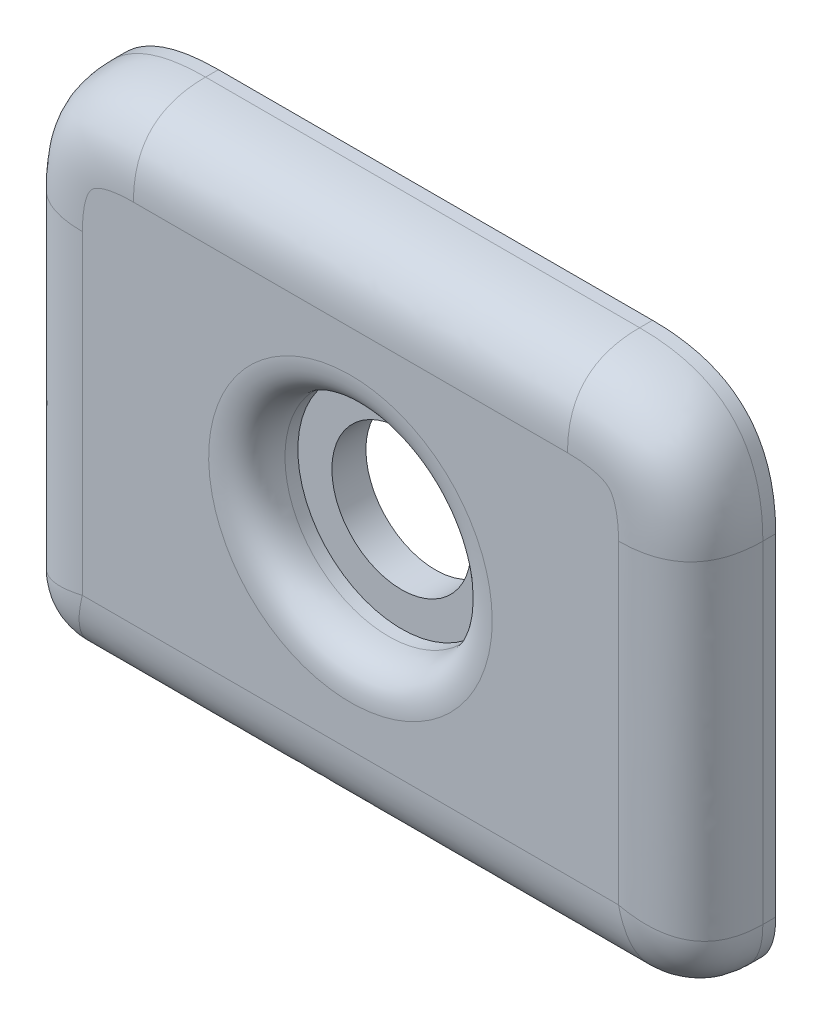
ISO-10303-21;
HEADER;
FILE_DESCRIPTION(('STEP AP214'),'2;1');
FILE_NAME('part.step','',(''),(''),'','','');
FILE_SCHEMA(('AUTOMOTIVE_DESIGN { 1 0 10303 214 1 1 1 1 }'));
ENDSEC;
DATA;
#1=APPLICATION_CONTEXT('core data for automotive mechanical design processes');
#2=APPLICATION_PROTOCOL_DEFINITION('international standard','automotive_design',2000,#1);
#3=PRODUCT_CONTEXT('',#1,'mechanical');
#4=PRODUCT('Part','Part','',(#3));
#5=PRODUCT_RELATED_PRODUCT_CATEGORY('part','',(#4));
#6=PRODUCT_DEFINITION_FORMATION('','',#4);
#7=PRODUCT_DEFINITION_CONTEXT('part definition',#1,'design');
#8=PRODUCT_DEFINITION('design','',#6,#7);
#9=PRODUCT_DEFINITION_SHAPE('','',#8);
#10=(LENGTH_UNIT() NAMED_UNIT(*) SI_UNIT(.MILLI.,.METRE.));
#11=(NAMED_UNIT(*) PLANE_ANGLE_UNIT() SI_UNIT($,.RADIAN.));
#12=(NAMED_UNIT(*) SI_UNIT($,.STERADIAN.) SOLID_ANGLE_UNIT());
#13=UNCERTAINTY_MEASURE_WITH_UNIT(LENGTH_MEASURE(1.E-05),#10,'distance_accuracy_value','');
#14=(GEOMETRIC_REPRESENTATION_CONTEXT(3) GLOBAL_UNCERTAINTY_ASSIGNED_CONTEXT((#13)) GLOBAL_UNIT_ASSIGNED_CONTEXT((#10,
#11,#12)) REPRESENTATION_CONTEXT('',''));
#15=CARTESIAN_POINT('',(0.,0.,0.));
#16=DIRECTION('',(0.,0.,1.));
#17=DIRECTION('',(1.,0.,0.));
#18=AXIS2_PLACEMENT_3D('',#15,#16,#17);
#19=CARTESIAN_POINT('',(0.,0.,0.));
#20=DIRECTION('',(0.,0.,1.));
#21=DIRECTION('',(1.,0.,0.));
#22=AXIS2_PLACEMENT_3D('',#19,#20,#21);
#23=PLANE('',#22);
#24=DIRECTION('',(-1.,0.,0.));
#25=VECTOR('',#24,1.);
#26=CARTESIAN_POINT('',(0.,-15.,0.));
#27=LINE('',#26,#25);
#28=CARTESIAN_POINT('',(16.75736,-15.,0.));
#29=VERTEX_POINT('',#28);
#30=CARTESIAN_POINT('',(-16.75736,-15.,0.));
#31=VERTEX_POINT('',#30);
#32=EDGE_CURVE('E11',#29,#31,#27,.T.);
#33=ORIENTED_EDGE('',*,*,#32,.T.);
#34=CARTESIAN_POINT('',(-20.,-11.75736,0.));
#35=CARTESIAN_POINT('',(-20.,-15.,0.));
#36=CARTESIAN_POINT('',(-16.75736,-15.,0.));
#37=B_SPLINE_CURVE_WITH_KNOTS('',2,(#34,#35,#36),.UNSPECIFIED.,.F.,.F.,(3,3),(0.,1.),.UNSPECIFIED.);
#38=CARTESIAN_POINT('',(-20.,-11.75736,0.));
#39=VERTEX_POINT('',#38);
#40=EDGE_CURVE('E26',#31,#39,#37,.F.);
#41=ORIENTED_EDGE('',*,*,#40,.T.);
#42=DIRECTION('',(0.,-1.,0.));
#43=VECTOR('',#42,1.);
#44=CARTESIAN_POINT('',(-20.,0.,0.));
#45=LINE('',#44,#43);
#46=CARTESIAN_POINT('',(-20.,7.75736,0.));
#47=VERTEX_POINT('',#46);
#48=EDGE_CURVE('E501',#47,#39,#45,.T.);
#49=ORIENTED_EDGE('',*,*,#48,.F.);
#50=CARTESIAN_POINT('',(-12.75736,15.,0.));
#51=CARTESIAN_POINT('',(-20.,15.,0.));
#52=CARTESIAN_POINT('',(-20.,7.75736,0.));
#53=B_SPLINE_CURVE_WITH_KNOTS('',2,(#50,#51,#52),.UNSPECIFIED.,.F.,.F.,(3,3),(0.,1.),.UNSPECIFIED.);
#54=CARTESIAN_POINT('',(-12.75736,15.,0.));
#55=VERTEX_POINT('',#54);
#56=EDGE_CURVE('E589',#47,#55,#53,.F.);
#57=ORIENTED_EDGE('',*,*,#56,.T.);
#58=DIRECTION('',(-1.,0.,0.));
#59=VECTOR('',#58,1.);
#60=CARTESIAN_POINT('',(0.,15.,0.));
#61=LINE('',#60,#59);
#62=CARTESIAN_POINT('',(12.75736,15.,0.));
#63=VERTEX_POINT('',#62);
#64=EDGE_CURVE('E912',#63,#55,#61,.T.);
#65=ORIENTED_EDGE('',*,*,#64,.F.);
#66=CARTESIAN_POINT('',(20.,7.75736,0.));
#67=CARTESIAN_POINT('',(20.,15.,0.));
#68=CARTESIAN_POINT('',(12.75736,15.,0.));
#69=B_SPLINE_CURVE_WITH_KNOTS('',2,(#66,#67,#68),.UNSPECIFIED.,.F.,.F.,(3,3),(0.,1.),.UNSPECIFIED.);
#70=CARTESIAN_POINT('',(20.,7.75736,0.));
#71=VERTEX_POINT('',#70);
#72=EDGE_CURVE('E900',#63,#71,#69,.F.);
#73=ORIENTED_EDGE('',*,*,#72,.T.);
#74=DIRECTION('',(0.,-1.,0.));
#75=VECTOR('',#74,1.);
#76=CARTESIAN_POINT('',(20.,0.,0.));
#77=LINE('',#76,#75);
#78=CARTESIAN_POINT('',(20.,-11.75736,0.));
#79=VERTEX_POINT('',#78);
#80=EDGE_CURVE('E856',#71,#79,#77,.T.);
#81=ORIENTED_EDGE('',*,*,#80,.T.);
#82=CARTESIAN_POINT('',(16.75736,-15.,0.));
#83=CARTESIAN_POINT('',(20.,-15.,0.));
#84=CARTESIAN_POINT('',(20.,-11.75736,0.));
#85=B_SPLINE_CURVE_WITH_KNOTS('',2,(#82,#83,#84),.UNSPECIFIED.,.F.,.F.,(3,3),(0.,1.),.UNSPECIFIED.);
#86=EDGE_CURVE('E487',#79,#29,#85,.F.);
#87=ORIENTED_EDGE('',*,*,#86,.T.);
#88=EDGE_LOOP('',(#33,#41,#49,#57,#65,#73,#81,#87));
#89=FACE_BOUND('',#88,.T.);
#90=CARTESIAN_POINT('',(0.,0.,0.));
#91=DIRECTION('',(0.,0.,-1.));
#92=DIRECTION('',(-1.,0.,0.));
#93=AXIS2_PLACEMENT_3D('',#90,#91,#92);
#94=CIRCLE('',#93,4.09);
#95=CARTESIAN_POINT('',(-4.09,0.,0.));
#96=VERTEX_POINT('',#95);
#97=EDGE_CURVE('E887',#96,#96,#94,.T.);
#98=ORIENTED_EDGE('',*,*,#97,.F.);
#99=EDGE_LOOP('',(#98));
#100=FACE_BOUND('',#99,.T.);
#101=CARTESIAN_POINT('',(0.,13.,0.));
#102=DIRECTION('',(0.,0.,1.));
#103=DIRECTION('',(-1.,0.,0.));
#104=AXIS2_PLACEMENT_3D('',#101,#102,#103);
#105=CIRCLE('',#104,1.15);
#106=CARTESIAN_POINT('',(-1.15,13.,0.));
#107=VERTEX_POINT('',#106);
#108=EDGE_CURVE('E884',#107,#107,#105,.T.);
#109=ORIENTED_EDGE('',*,*,#108,.T.);
#110=EDGE_LOOP('',(#109));
#111=FACE_BOUND('',#110,.T.);
#112=CARTESIAN_POINT('',(0.,-13.,0.));
#113=DIRECTION('',(0.,0.,-1.));
#114=DIRECTION('',(-1.,0.,0.));
#115=AXIS2_PLACEMENT_3D('',#112,#113,#114);
#116=CIRCLE('',#115,1.15);
#117=CARTESIAN_POINT('',(-1.15,-13.,0.));
#118=VERTEX_POINT('',#117);
#119=EDGE_CURVE('E881',#118,#118,#116,.T.);
#120=ORIENTED_EDGE('',*,*,#119,.F.);
#121=EDGE_LOOP('',(#120));
#122=FACE_BOUND('',#121,.T.);
#123=ADVANCED_FACE('F17',(#89,#100,#111,#122),#23,.F.);
#124=CARTESIAN_POINT('',(0.,0.,3.));
#125=DIRECTION('',(0.,0.,-1.));
#126=DIRECTION('',(-1.,0.,0.));
#127=AXIS2_PLACEMENT_3D('',#124,#125,#126);
#128=CYLINDRICAL_SURFACE('',#127,4.09);
#129=ORIENTED_EDGE('',*,*,#97,.T.);
#130=EDGE_LOOP('',(#129));
#131=FACE_BOUND('',#130,.T.);
#132=CARTESIAN_POINT('',(0.,0.,2.));
#133=DIRECTION('',(0.,0.,1.));
#134=DIRECTION('',(1.,0.,0.));
#135=AXIS2_PLACEMENT_3D('',#132,#133,#134);
#136=CIRCLE('',#135,4.09);
#137=CARTESIAN_POINT('',(4.09,0.,2.));
#138=VERTEX_POINT('',#137);
#139=EDGE_CURVE('E878',#138,#138,#136,.F.);
#140=ORIENTED_EDGE('',*,*,#139,.F.);
#141=EDGE_LOOP('',(#140));
#142=FACE_BOUND('',#141,.T.);
#143=ADVANCED_FACE('F937',(#131,#142),#128,.F.);
#144=CARTESIAN_POINT('',(20.,0.,5.));
#145=DIRECTION('',(1.,0.,0.));
#146=DIRECTION('',(0.,1.,0.));
#147=AXIS2_PLACEMENT_3D('',#144,#145,#146);
#148=PLANE('',#147);
#149=CARTESIAN_POINT('',(20.,7.75736,5.25));
#150=CARTESIAN_POINT('',(20.,7.75736,3.41666666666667));
#151=CARTESIAN_POINT('',(20.,7.75736,1.58333333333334));
#152=CARTESIAN_POINT('',(20.,7.75736,-0.25));
#153=B_SPLINE_CURVE_WITH_KNOTS('',3,(#149,#150,#151,#152),.UNSPECIFIED.,.F.,.F.,(4,4),(-0.00525,
0.00025),.UNSPECIFIED.);
#154=CARTESIAN_POINT('',(20.,7.75736,0.75736));
#155=VERTEX_POINT('',#154);
#156=EDGE_CURVE('E408',#71,#155,#153,.F.);
#157=ORIENTED_EDGE('',*,*,#156,.T.);
#158=CARTESIAN_POINT('',(20.,-11.75736,0.75736));
#159=CARTESIAN_POINT('',(20.,-5.25245333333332,0.75736));
#160=CARTESIAN_POINT('',(20.,1.25245333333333,0.75736));
#161=CARTESIAN_POINT('',(20.,7.75736,0.75736));
#162=B_SPLINE_CURVE_WITH_KNOTS('',3,(#158,#159,#160,#161),.UNSPECIFIED.,.F.,.F.,(4,4),
(-0.00775736,0.01175736),.UNSPECIFIED.);
#163=CARTESIAN_POINT('',(20.,-11.75736,0.75736));
#164=VERTEX_POINT('',#163);
#165=EDGE_CURVE('E416',#155,#164,#162,.F.);
#166=ORIENTED_EDGE('',*,*,#165,.T.);
#167=CARTESIAN_POINT('',(20.,-11.75736,-0.25));
#168=CARTESIAN_POINT('',(20.,-11.75736,1.58333333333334));
#169=CARTESIAN_POINT('',(20.,-11.75736,3.41666666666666));
#170=CARTESIAN_POINT('',(20.,-11.75736,5.25));
#171=B_SPLINE_CURVE_WITH_KNOTS('',3,(#167,#168,#169,#170),.UNSPECIFIED.,.F.,.F.,(4,4),(-0.00025,
0.00525),.UNSPECIFIED.);
#172=EDGE_CURVE('E424',#164,#79,#171,.F.);
#173=ORIENTED_EDGE('',*,*,#172,.T.);
#174=ORIENTED_EDGE('',*,*,#80,.F.);
#175=EDGE_LOOP('',(#157,#166,#173,#174));
#176=FACE_BOUND('',#175,.T.);
#177=ADVANCED_FACE('F836',(#176),#148,.T.);
#178=CARTESIAN_POINT('',(0.,15.,5.));
#179=DIRECTION('',(0.,-1.,0.));
#180=DIRECTION('',(1.,0.,0.));
#181=AXIS2_PLACEMENT_3D('',#178,#179,#180);
#182=PLANE('',#181);
#183=CARTESIAN_POINT('',(-12.75736,15.,5.25));
#184=CARTESIAN_POINT('',(-12.75736,15.,3.41666666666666));
#185=CARTESIAN_POINT('',(-12.75736,15.,1.58333333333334));
#186=CARTESIAN_POINT('',(-12.75736,15.,-0.25));
#187=B_SPLINE_CURVE_WITH_KNOTS('',3,(#183,#184,#185,#186),.UNSPECIFIED.,.F.,.F.,(4,4),(-0.00025,
0.00525),.UNSPECIFIED.);
#188=CARTESIAN_POINT('',(-12.75736,15.,0.75736));
#189=VERTEX_POINT('',#188);
#190=EDGE_CURVE('E599',#55,#189,#187,.F.);
#191=ORIENTED_EDGE('',*,*,#190,.T.);
#192=CARTESIAN_POINT('',(12.75736,15.,0.75736));
#193=CARTESIAN_POINT('',(4.25245333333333,15.,0.75736));
#194=CARTESIAN_POINT('',(-4.25245333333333,15.,0.75736));
#195=CARTESIAN_POINT('',(-12.75736,15.,0.75736));
#196=B_SPLINE_CURVE_WITH_KNOTS('',3,(#192,#193,#194,#195),.UNSPECIFIED.,.F.,.F.,(4,4),
(-0.01275736,0.01275736),.UNSPECIFIED.);
#197=CARTESIAN_POINT('',(12.75736,15.,0.75736));
#198=VERTEX_POINT('',#197);
#199=EDGE_CURVE('E121',#189,#198,#196,.F.);
#200=ORIENTED_EDGE('',*,*,#199,.T.);
#201=CARTESIAN_POINT('',(12.75736,15.,-0.25));
#202=CARTESIAN_POINT('',(12.75736,15.,1.58333333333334));
#203=CARTESIAN_POINT('',(12.75736,15.,3.41666666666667));
#204=CARTESIAN_POINT('',(12.75736,15.,5.25));
#205=B_SPLINE_CURVE_WITH_KNOTS('',3,(#201,#202,#203,#204),.UNSPECIFIED.,.F.,.F.,(4,4),(-0.00525,
0.00025),.UNSPECIFIED.);
#206=EDGE_CURVE('E411',#198,#63,#205,.F.);
#207=ORIENTED_EDGE('',*,*,#206,.T.);
#208=ORIENTED_EDGE('',*,*,#64,.T.);
#209=EDGE_LOOP('',(#191,#200,#207,#208));
#210=FACE_BOUND('',#209,.T.);
#211=ADVANCED_FACE('F827',(#210),#182,.F.);
#212=CARTESIAN_POINT('',(-20.,0.,5.));
#213=DIRECTION('',(1.,0.,0.));
#214=DIRECTION('',(0.,1.,0.));
#215=AXIS2_PLACEMENT_3D('',#212,#213,#214);
#216=PLANE('',#215);
#217=CARTESIAN_POINT('',(-20.,-11.75736,5.25));
#218=CARTESIAN_POINT('',(-20.,-11.75736,3.41666666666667));
#219=CARTESIAN_POINT('',(-20.,-11.75736,1.58333333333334));
#220=CARTESIAN_POINT('',(-20.,-11.75736,-0.25));
#221=B_SPLINE_CURVE_WITH_KNOTS('',3,(#217,#218,#219,#220),.UNSPECIFIED.,.F.,.F.,(4,4),(-0.00525,
0.00025),.UNSPECIFIED.);
#222=CARTESIAN_POINT('',(-20.,-11.75736,0.75736));
#223=VERTEX_POINT('',#222);
#224=EDGE_CURVE('E499',#39,#223,#221,.F.);
#225=ORIENTED_EDGE('',*,*,#224,.T.);
#226=CARTESIAN_POINT('',(-20.,7.75736,0.75736));
#227=CARTESIAN_POINT('',(-20.,1.25245333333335,0.75736));
#228=CARTESIAN_POINT('',(-20.,-5.25245333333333,0.75736));
#229=CARTESIAN_POINT('',(-20.,-11.75736,0.75736));
#230=B_SPLINE_CURVE_WITH_KNOTS('',3,(#226,#227,#228,#229),.UNSPECIFIED.,.F.,.F.,(4,4),
(-0.01175736,0.00775736),.UNSPECIFIED.);
#231=CARTESIAN_POINT('',(-20.,7.75736,0.75736));
#232=VERTEX_POINT('',#231);
#233=EDGE_CURVE('E200',#223,#232,#230,.F.);
#234=ORIENTED_EDGE('',*,*,#233,.T.);
#235=CARTESIAN_POINT('',(-20.,7.75736,-0.25));
#236=CARTESIAN_POINT('',(-20.,7.75736,1.58333333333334));
#237=CARTESIAN_POINT('',(-20.,7.75736,3.41666666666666));
#238=CARTESIAN_POINT('',(-20.,7.75736,5.25));
#239=B_SPLINE_CURVE_WITH_KNOTS('',3,(#235,#236,#237,#238),.UNSPECIFIED.,.F.,.F.,(4,4),(-0.00025,
0.00525),.UNSPECIFIED.);
#240=EDGE_CURVE('E490',#232,#47,#239,.F.);
#241=ORIENTED_EDGE('',*,*,#240,.T.);
#242=ORIENTED_EDGE('',*,*,#48,.T.);
#243=EDGE_LOOP('',(#225,#234,#241,#242));
#244=FACE_BOUND('',#243,.T.);
#245=ADVANCED_FACE('F774',(#244),#216,.F.);
#246=CARTESIAN_POINT('',(0.,-15.,5.));
#247=DIRECTION('',(0.,-1.,0.));
#248=DIRECTION('',(1.,0.,0.));
#249=AXIS2_PLACEMENT_3D('',#246,#247,#248);
#250=PLANE('',#249);
#251=CARTESIAN_POINT('',(16.75736,-15.,5.25));
#252=CARTESIAN_POINT('',(16.75736,-15.,3.41666666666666));
#253=CARTESIAN_POINT('',(16.75736,-15.,1.58333333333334));
#254=CARTESIAN_POINT('',(16.75736,-15.,-0.25));
#255=B_SPLINE_CURVE_WITH_KNOTS('',3,(#251,#252,#253,#254),.UNSPECIFIED.,.F.,.F.,(4,4),(-0.00025,
0.00525),.UNSPECIFIED.);
#256=CARTESIAN_POINT('',(16.75736,-15.,0.75736));
#257=VERTEX_POINT('',#256);
#258=EDGE_CURVE('E479',#29,#257,#255,.F.);
#259=ORIENTED_EDGE('',*,*,#258,.T.);
#260=CARTESIAN_POINT('',(-16.75736,-15.,0.75736));
#261=CARTESIAN_POINT('',(-5.58578666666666,-15.,0.75736));
#262=CARTESIAN_POINT('',(5.58578666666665,-15.,0.75736));
#263=CARTESIAN_POINT('',(16.75736,-15.,0.75736));
#264=B_SPLINE_CURVE_WITH_KNOTS('',3,(#260,#261,#262,#263),.UNSPECIFIED.,.F.,.F.,(4,4),
(-0.01675736,0.01675736),.UNSPECIFIED.);
#265=CARTESIAN_POINT('',(-16.75736,-15.,0.75736));
#266=VERTEX_POINT('',#265);
#267=EDGE_CURVE('E273',#257,#266,#264,.F.);
#268=ORIENTED_EDGE('',*,*,#267,.T.);
#269=CARTESIAN_POINT('',(-16.75736,-15.,-0.25));
#270=CARTESIAN_POINT('',(-16.75736,-15.,1.58333333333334));
#271=CARTESIAN_POINT('',(-16.75736,-15.,3.41666666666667));
#272=CARTESIAN_POINT('',(-16.75736,-15.,5.25));
#273=B_SPLINE_CURVE_WITH_KNOTS('',3,(#269,#270,#271,#272),.UNSPECIFIED.,.F.,.F.,(4,4),(-0.00525,
0.00025),.UNSPECIFIED.);
#274=EDGE_CURVE('E136',#266,#31,#273,.F.);
#275=ORIENTED_EDGE('',*,*,#274,.T.);
#276=ORIENTED_EDGE('',*,*,#32,.F.);
#277=EDGE_LOOP('',(#259,#268,#275,#276));
#278=FACE_BOUND('',#277,.T.);
#279=ADVANCED_FACE('F494',(#278),#250,.T.);
#280=CARTESIAN_POINT('',(0.,0.,5.));
#281=DIRECTION('',(0.,0.,1.));
#282=DIRECTION('',(1.,0.,0.));
#283=AXIS2_PLACEMENT_3D('',#280,#281,#282);
#284=PLANE('',#283);
#285=CARTESIAN_POINT('',(-15.75736,7.75736,5.));
#286=CARTESIAN_POINT('',(-15.7573600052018,8.18029835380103,5.));
#287=CARTESIAN_POINT('',(-15.7334156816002,8.60052802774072,5.));
#288=CARTESIAN_POINT('',(-15.625707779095,9.221819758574,5.));
#289=CARTESIAN_POINT('',(-15.5775638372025,9.4290655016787,5.));
#290=CARTESIAN_POINT('',(-15.4715236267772,9.73006261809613,5.));
#291=CARTESIAN_POINT('',(-15.4308096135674,9.82796246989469,5.));
#292=CARTESIAN_POINT('',(-15.3559745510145,9.96857420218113,5.));
#293=CARTESIAN_POINT('',(-15.3285496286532,10.0145919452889,5.));
#294=CARTESIAN_POINT('',(-15.2673200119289,10.1025369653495,5.));
#295=CARTESIAN_POINT('',(-15.2338828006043,10.1437836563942,5.));
#296=CARTESIAN_POINT('',(-15.1599993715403,10.2195078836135,5.));
#297=CARTESIAN_POINT('',(-15.1195281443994,10.2539612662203,5.));
#298=CARTESIAN_POINT('',(-15.0325688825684,10.3170571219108,5.));
#299=CARTESIAN_POINT('',(-14.9870748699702,10.3451516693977,5.));
#300=CARTESIAN_POINT('',(-14.8471557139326,10.4220626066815,5.));
#301=CARTESIAN_POINT('',(-14.7487431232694,10.4640451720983,5.));
#302=CARTESIAN_POINT('',(-14.4471241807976,10.5727712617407,5.));
#303=CARTESIAN_POINT('',(-14.239929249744,10.6219046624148,5.));
#304=CARTESIAN_POINT('',(-13.6088949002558,10.7332246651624,5.));
#305=CARTESIAN_POINT('',(-13.1836772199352,10.7573600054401,5.));
#306=CARTESIAN_POINT('',(-12.75736,10.75736,5.));
#307=B_SPLINE_CURVE_WITH_KNOTS('',3,(#285,#286,#287,#288,#289,#290,#291,#292,#293,#294,#295,
#296,#297,#298,#299,#300,#301,#302,#303,#304,#305,#306),.UNSPECIFIED.,.F.,.F.,(4,2,2,2,2,2,2,2,
2,2,4),(0.,0.00127602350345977,0.00191403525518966,0.0022330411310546,0.00239254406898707,
0.00255204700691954,0.00271154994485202,0.00287105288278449,0.00319005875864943,
0.00382807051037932,0.00510409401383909),.UNSPECIFIED.);
#308=CARTESIAN_POINT('',(-12.75736,10.75736,5.));
#309=VERTEX_POINT('',#308);
#310=CARTESIAN_POINT('',(-15.75736,7.75736,5.));
#311=VERTEX_POINT('',#310);
#312=EDGE_CURVE('E103',#309,#311,#307,.F.);
#313=ORIENTED_EDGE('',*,*,#312,.T.);
#314=CARTESIAN_POINT('',(-15.75736,-11.75736,5.));
#315=CARTESIAN_POINT('',(-15.75736,-5.25245333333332,5.));
#316=CARTESIAN_POINT('',(-15.75736,1.25245333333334,5.));
#317=CARTESIAN_POINT('',(-15.75736,7.75736,5.));
#318=B_SPLINE_CURVE_WITH_KNOTS('',3,(#314,#315,#316,#317),.UNSPECIFIED.,.F.,.F.,(4,4),
(-0.01175736,0.00775736),.UNSPECIFIED.);
#319=CARTESIAN_POINT('',(-15.75736,-10.75736,5.));
#320=VERTEX_POINT('',#319);
#321=EDGE_CURVE('E137',#311,#320,#318,.F.);
#322=ORIENTED_EDGE('',*,*,#321,.T.);
#323=CARTESIAN_POINT('',(16.75736,-10.75736,5.));
#324=CARTESIAN_POINT('',(5.58578666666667,-10.75736,5.));
#325=CARTESIAN_POINT('',(-5.58578666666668,-10.75736,5.));
#326=CARTESIAN_POINT('',(-16.75736,-10.75736,5.));
#327=B_SPLINE_CURVE_WITH_KNOTS('',3,(#323,#324,#325,#326),.UNSPECIFIED.,.F.,.F.,(4,4),
(-0.01675736,0.01675736),.UNSPECIFIED.);
#328=CARTESIAN_POINT('',(15.75736,-10.75736,5.));
#329=VERTEX_POINT('',#328);
#330=EDGE_CURVE('E271',#320,#329,#327,.F.);
#331=ORIENTED_EDGE('',*,*,#330,.T.);
#332=CARTESIAN_POINT('',(15.75736,7.75736,5.));
#333=CARTESIAN_POINT('',(15.75736,1.25245333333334,5.));
#334=CARTESIAN_POINT('',(15.75736,-5.25245333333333,5.));
#335=CARTESIAN_POINT('',(15.75736,-11.75736,5.));
#336=B_SPLINE_CURVE_WITH_KNOTS('',3,(#332,#333,#334,#335),.UNSPECIFIED.,.F.,.F.,(4,4),
(-0.00775736,0.01175736),.UNSPECIFIED.);
#337=CARTESIAN_POINT('',(15.75736,7.75736,5.));
#338=VERTEX_POINT('',#337);
#339=EDGE_CURVE('E728',#329,#338,#336,.F.);
#340=ORIENTED_EDGE('',*,*,#339,.T.);
#341=CARTESIAN_POINT('',(12.75736,10.75736,5.));
#342=CARTESIAN_POINT('',(13.1802983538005,10.7573600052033,5.));
#343=CARTESIAN_POINT('',(13.6005280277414,10.7334156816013,5.));
#344=CARTESIAN_POINT('',(14.2218197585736,10.6257077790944,5.));
#345=CARTESIAN_POINT('',(14.4290655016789,10.5775638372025,5.));
#346=CARTESIAN_POINT('',(14.730062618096,10.4715236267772,5.));
#347=CARTESIAN_POINT('',(14.8279624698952,10.4308096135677,5.));
#348=CARTESIAN_POINT('',(14.9685742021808,10.3559745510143,5.));
#349=CARTESIAN_POINT('',(15.0145919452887,10.3285496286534,5.));
#350=CARTESIAN_POINT('',(15.1025369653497,10.2673200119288,5.));
#351=CARTESIAN_POINT('',(15.1437836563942,10.2338828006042,5.));
#352=CARTESIAN_POINT('',(15.2195078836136,10.1599993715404,5.));
#353=CARTESIAN_POINT('',(15.2539612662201,10.1195281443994,5.));
#354=CARTESIAN_POINT('',(15.317057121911,10.0325688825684,5.));
#355=CARTESIAN_POINT('',(15.3451516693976,9.98707486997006,5.));
#356=CARTESIAN_POINT('',(15.4220626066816,9.84715571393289,5.));
#357=CARTESIAN_POINT('',(15.4640451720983,9.74874312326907,5.));
#358=CARTESIAN_POINT('',(15.5727712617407,9.44712418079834,5.));
#359=CARTESIAN_POINT('',(15.6219046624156,9.23992924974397,5.));
#360=CARTESIAN_POINT('',(15.733224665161,8.60889490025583,5.));
#361=CARTESIAN_POINT('',(15.7573600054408,8.18367721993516,5.));
#362=CARTESIAN_POINT('',(15.75736,7.75736,5.));
#363=B_SPLINE_CURVE_WITH_KNOTS('',3,(#341,#342,#343,#344,#345,#346,#347,#348,#349,#350,#351,
#352,#353,#354,#355,#356,#357,#358,#359,#360,#361,#362),.UNSPECIFIED.,.F.,.F.,(4,2,2,2,2,2,2,2,
2,2,4),(0.,0.00127602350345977,0.00191403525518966,0.0022330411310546,0.00239254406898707,
0.00255204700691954,0.00271154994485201,0.00287105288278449,0.00319005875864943,
0.00382807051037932,0.00510409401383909),.UNSPECIFIED.);
#364=CARTESIAN_POINT('',(12.75736,10.75736,5.));
#365=VERTEX_POINT('',#364);
#366=EDGE_CURVE('E107',#338,#365,#363,.F.);
#367=ORIENTED_EDGE('',*,*,#366,.T.);
#368=CARTESIAN_POINT('',(-12.75736,10.75736,5.));
#369=CARTESIAN_POINT('',(-4.25245333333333,10.75736,5.));
#370=CARTESIAN_POINT('',(4.25245333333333,10.75736,5.));
#371=CARTESIAN_POINT('',(12.75736,10.75736,5.));
#372=B_SPLINE_CURVE_WITH_KNOTS('',3,(#368,#369,#370,#371),.UNSPECIFIED.,.F.,.F.,(4,4),
(-0.01275736,0.01275736),.UNSPECIFIED.);
#373=EDGE_CURVE('E97',#365,#309,#372,.F.);
#374=ORIENTED_EDGE('',*,*,#373,.T.);
#375=EDGE_LOOP('',(#313,#322,#331,#340,#367,#374));
#376=FACE_BOUND('',#375,.T.);
#377=CARTESIAN_POINT('',(8.33264,0.,5.));
#378=CARTESIAN_POINT('',(8.33264,1.0907400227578,5.));
#379=CARTESIAN_POINT('',(8.11576368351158,2.18105089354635,5.));
#380=CARTESIAN_POINT('',(7.28094741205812,4.19647565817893,5.));
#381=CARTESIAN_POINT('',(6.66333591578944,5.12079658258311,5.));
#382=CARTESIAN_POINT('',(5.12079658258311,6.66333591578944,5.));
#383=CARTESIAN_POINT('',(4.19647565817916,7.28094741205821,5.));
#384=CARTESIAN_POINT('',(2.18105089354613,8.11576368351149,5.));
#385=CARTESIAN_POINT('',(1.09074002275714,8.33264,5.));
#386=CARTESIAN_POINT('',(-1.09074002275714,8.33264,5.));
#387=CARTESIAN_POINT('',(-2.18105089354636,8.11576368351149,5.));
#388=CARTESIAN_POINT('',(-4.19647565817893,7.28094741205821,5.));
#389=CARTESIAN_POINT('',(-5.12079658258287,6.66333591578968,5.));
#390=CARTESIAN_POINT('',(-6.66333591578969,5.12079658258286,5.));
#391=CARTESIAN_POINT('',(-7.2809474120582,4.19647565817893,5.));
#392=CARTESIAN_POINT('',(-8.11576368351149,2.18105089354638,5.));
#393=CARTESIAN_POINT('',(-8.33264,1.09074002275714,5.));
#394=CARTESIAN_POINT('',(-8.33264,-1.09074002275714,5.));
#395=CARTESIAN_POINT('',(-8.1157636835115,-2.18105089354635,5.));
#396=CARTESIAN_POINT('',(-7.28094741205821,-4.19647565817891,5.));
#397=CARTESIAN_POINT('',(-6.6633359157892,-5.12079658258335,5.));
#398=CARTESIAN_POINT('',(-5.12079658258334,-6.66333591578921,5.));
#399=CARTESIAN_POINT('',(-4.19647565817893,-7.2809474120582,5.));
#400=CARTESIAN_POINT('',(-2.18105089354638,-8.11576368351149,5.));
#401=CARTESIAN_POINT('',(-1.09074002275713,-8.33264,5.));
#402=CARTESIAN_POINT('',(1.09074002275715,-8.33264,5.));
#403=CARTESIAN_POINT('',(2.18105089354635,-8.1157636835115,5.));
#404=CARTESIAN_POINT('',(4.19647565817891,-7.28094741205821,5.));
#405=CARTESIAN_POINT('',(5.12079658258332,-6.6633359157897,5.));
#406=CARTESIAN_POINT('',(6.66333591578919,-5.12079658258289,5.));
#407=CARTESIAN_POINT('',(7.2809474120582,-4.19647565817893,5.));
#408=CARTESIAN_POINT('',(8.11576368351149,-2.18105089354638,5.));
#409=CARTESIAN_POINT('',(8.33264,-1.0907400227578,5.));
#410=CARTESIAN_POINT('',(8.33264,0.,5.));
#411=B_SPLINE_CURVE_WITH_KNOTS('',3,(#377,#378,#379,#380,#381,#382,#383,#384,#385,#386,#387,
#388,#389,#390,#391,#392,#393,#394,#395,#396,#397,#398,#399,#400,#401,#402,#403,#404,#405,#406,
#407,#408,#409,#410),.UNSPECIFIED.,.T.,.F.,(4,2,2,2,2,2,2,2,2,2,2,2,2,2,2,2,4),(0.,
0.392699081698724,0.785398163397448,1.17809724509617,1.5707963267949,1.96349540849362,
2.35619449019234,2.74889357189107,3.14159265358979,3.53429173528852,3.92699081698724,
4.31968989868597,4.71238898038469,5.10508806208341,5.49778714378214,5.89048622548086,
6.28318530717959),.UNSPECIFIED.);
#412=CARTESIAN_POINT('',(8.33264,0.,5.));
#413=VERTEX_POINT('',#412);
#414=EDGE_CURVE('E113',#413,#413,#411,.F.);
#415=ORIENTED_EDGE('',*,*,#414,.T.);
#416=EDGE_LOOP('',(#415));
#417=FACE_BOUND('',#416,.T.);
#418=ADVANCED_FACE('F100',(#376,#417),#284,.T.);
#419=CARTESIAN_POINT('',(0.,0.,2.));
#420=DIRECTION('',(0.,0.,1.));
#421=DIRECTION('',(1.,0.,0.));
#422=AXIS2_PLACEMENT_3D('',#419,#420,#421);
#423=PLANE('',#422);
#424=CARTESIAN_POINT('',(0.,0.,2.));
#425=DIRECTION('',(0.,0.,1.));
#426=DIRECTION('',(1.,0.,0.));
#427=AXIS2_PLACEMENT_3D('',#424,#425,#426);
#428=CIRCLE('',#427,6.09);
#429=CARTESIAN_POINT('',(6.09,0.,2.));
#430=VERTEX_POINT('',#429);
#431=EDGE_CURVE('E675',#430,#430,#428,.T.);
#432=ORIENTED_EDGE('',*,*,#431,.T.);
#433=EDGE_LOOP('',(#432));
#434=FACE_BOUND('',#433,.T.);
#435=ORIENTED_EDGE('',*,*,#139,.T.);
#436=EDGE_LOOP('',(#435));
#437=FACE_BOUND('',#436,.T.);
#438=ADVANCED_FACE('F690',(#434,#437),#423,.T.);
#439=CARTESIAN_POINT('',(0.,0.,2.));
#440=DIRECTION('',(0.,0.,1.));
#441=DIRECTION('',(1.,0.,0.));
#442=AXIS2_PLACEMENT_3D('',#439,#440,#441);
#443=CYLINDRICAL_SURFACE('',#442,6.09);
#444=CARTESIAN_POINT('',(6.09,0.,2.75736));
#445=CARTESIAN_POINT('',(6.09,-0.797179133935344,2.75736));
#446=CARTESIAN_POINT('',(5.93149360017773,-1.59404461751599,2.75736));
#447=CARTESIAN_POINT('',(5.32135910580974,-3.06703958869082,2.75736));
#448=CARTESIAN_POINT('',(4.86997106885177,-3.74258952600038,2.75736));
#449=CARTESIAN_POINT('',(3.74258952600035,-4.86997106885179,2.75736));
#450=CARTESIAN_POINT('',(3.06703958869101,-5.32135910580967,2.75736));
#451=CARTESIAN_POINT('',(1.59404461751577,-5.93149360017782,2.75736));
#452=CARTESIAN_POINT('',(0.797179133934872,-6.09,2.75736));
#453=CARTESIAN_POINT('',(-0.797179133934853,-6.09,2.75736));
#454=CARTESIAN_POINT('',(-1.59404461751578,-5.93149360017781,2.75736));
#455=CARTESIAN_POINT('',(-3.06703958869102,-5.32135910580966,2.75736));
#456=CARTESIAN_POINT('',(-3.74258952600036,-4.86997106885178,2.75736));
#457=CARTESIAN_POINT('',(-4.86997106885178,-3.74258952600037,2.75736));
#458=CARTESIAN_POINT('',(-5.32135910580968,-3.06703958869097,2.75736));
#459=CARTESIAN_POINT('',(-5.9314936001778,-1.5940446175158,2.75736));
#460=CARTESIAN_POINT('',(-6.09,-0.797179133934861,2.75736));
#461=CARTESIAN_POINT('',(-6.09,0.797179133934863,2.75736));
#462=CARTESIAN_POINT('',(-5.9314936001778,1.59404461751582,2.75736));
#463=CARTESIAN_POINT('',(-5.32135910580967,3.06703958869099,2.75736));
#464=CARTESIAN_POINT('',(-4.86997106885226,3.74258952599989,2.75736));
#465=CARTESIAN_POINT('',(-3.7425895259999,4.86997106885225,2.75736));
#466=CARTESIAN_POINT('',(-3.06703958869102,5.32135910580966,2.75736));
#467=CARTESIAN_POINT('',(-1.59404461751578,5.93149360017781,2.75736));
#468=CARTESIAN_POINT('',(-0.797179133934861,6.09,2.75736));
#469=CARTESIAN_POINT('',(0.797179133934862,6.09,2.75736));
#470=CARTESIAN_POINT('',(1.59404461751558,5.9314936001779,2.75736));
#471=CARTESIAN_POINT('',(3.06703958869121,5.32135910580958,2.75736));
#472=CARTESIAN_POINT('',(3.74258952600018,4.86997106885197,2.75736));
#473=CARTESIAN_POINT('',(4.86997106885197,3.74258952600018,2.75736));
#474=CARTESIAN_POINT('',(5.32135910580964,3.06703958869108,2.75736));
#475=CARTESIAN_POINT('',(5.93149360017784,1.59404461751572,2.75736));
#476=CARTESIAN_POINT('',(6.09,0.797179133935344,2.75736));
#477=CARTESIAN_POINT('',(6.09,0.,2.75736));
#478=B_SPLINE_CURVE_WITH_KNOTS('',3,(#444,#445,#446,#447,#448,#449,#450,#451,#452,#453,#454,
#455,#456,#457,#458,#459,#460,#461,#462,#463,#464,#465,#466,#467,#468,#469,#470,#471,#472,#473,
#474,#475,#476,#477),.UNSPECIFIED.,.T.,.F.,(4,2,2,2,2,2,2,2,2,2,2,2,2,2,2,2,4),(0.,
0.39269908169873,0.78539816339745,1.17809724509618,1.5707963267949,1.96349540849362,
2.35619449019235,2.74889357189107,3.14159265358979,3.53429173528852,3.92699081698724,
4.31968989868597,4.7123889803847,5.10508806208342,5.49778714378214,5.89048622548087,
6.28318530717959),.UNSPECIFIED.);
#479=CARTESIAN_POINT('',(6.09,0.,2.75736));
#480=VERTEX_POINT('',#479);
#481=EDGE_CURVE('E622',#480,#480,#478,.F.);
#482=ORIENTED_EDGE('',*,*,#481,.T.);
#483=EDGE_LOOP('',(#482));
#484=FACE_BOUND('',#483,.T.);
#485=ORIENTED_EDGE('',*,*,#431,.F.);
#486=EDGE_LOOP('',(#485));
#487=FACE_BOUND('',#486,.T.);
#488=ADVANCED_FACE('F642',(#484,#487),#443,.F.);
#489=CARTESIAN_POINT('',(6.09,0.,2.75736));
#490=CARTESIAN_POINT('',(6.09,0.797179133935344,2.75736));
#491=CARTESIAN_POINT('',(5.93149360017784,1.59404461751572,2.75736));
#492=CARTESIAN_POINT('',(5.32135910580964,3.06703958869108,2.75736));
#493=CARTESIAN_POINT('',(4.86997106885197,3.74258952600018,2.75736));
#494=CARTESIAN_POINT('',(3.74258952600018,4.86997106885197,2.75736));
#495=CARTESIAN_POINT('',(3.06703958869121,5.32135910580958,2.75736));
#496=CARTESIAN_POINT('',(1.59404461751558,5.9314936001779,2.75736));
#497=CARTESIAN_POINT('',(0.797179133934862,6.09,2.75736));
#498=CARTESIAN_POINT('',(-0.797179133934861,6.09,2.75736));
#499=CARTESIAN_POINT('',(-1.59404461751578,5.93149360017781,2.75736));
#500=CARTESIAN_POINT('',(-3.06703958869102,5.32135910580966,2.75736));
#501=CARTESIAN_POINT('',(-3.7425895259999,4.86997106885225,2.75736));
#502=CARTESIAN_POINT('',(-4.86997106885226,3.74258952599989,2.75736));
#503=CARTESIAN_POINT('',(-5.32135910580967,3.06703958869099,2.75736));
#504=CARTESIAN_POINT('',(-5.9314936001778,1.59404461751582,2.75736));
#505=CARTESIAN_POINT('',(-6.09,0.797179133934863,2.75736));
#506=CARTESIAN_POINT('',(-6.09,-0.797179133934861,2.75736));
#507=CARTESIAN_POINT('',(-5.9314936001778,-1.5940446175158,2.75736));
#508=CARTESIAN_POINT('',(-5.32135910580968,-3.06703958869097,2.75736));
#509=CARTESIAN_POINT('',(-4.86997106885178,-3.74258952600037,2.75736));
#510=CARTESIAN_POINT('',(-3.74258952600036,-4.86997106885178,2.75736));
#511=CARTESIAN_POINT('',(-3.06703958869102,-5.32135910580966,2.75736));
#512=CARTESIAN_POINT('',(-1.59404461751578,-5.93149360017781,2.75736));
#513=CARTESIAN_POINT('',(-0.797179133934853,-6.09,2.75736));
#514=CARTESIAN_POINT('',(0.797179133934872,-6.09,2.75736));
#515=CARTESIAN_POINT('',(1.59404461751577,-5.93149360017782,2.75736));
#516=CARTESIAN_POINT('',(3.06703958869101,-5.32135910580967,2.75736));
#517=CARTESIAN_POINT('',(3.74258952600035,-4.86997106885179,2.75736));
#518=CARTESIAN_POINT('',(4.86997106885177,-3.74258952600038,2.75736));
#519=CARTESIAN_POINT('',(5.32135910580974,-3.06703958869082,2.75736));
#520=CARTESIAN_POINT('',(5.93149360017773,-1.59404461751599,2.75736));
#521=CARTESIAN_POINT('',(6.09,-0.797179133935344,2.75736));
#522=CARTESIAN_POINT('',(6.09,0.,2.75736));
#523=CARTESIAN_POINT('',(6.09,0.,5.));
#524=CARTESIAN_POINT('',(6.09,0.797179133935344,5.));
#525=CARTESIAN_POINT('',(5.93149360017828,1.5940446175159,5.));
#526=CARTESIAN_POINT('',(5.3213591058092,3.06703958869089,5.));
#527=CARTESIAN_POINT('',(4.86997106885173,3.74258952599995,4.99999999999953));
#528=CARTESIAN_POINT('',(3.74258952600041,4.86997106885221,5.00000000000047));
#529=CARTESIAN_POINT('',(3.06703958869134,5.32135910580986,5.00000000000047));
#530=CARTESIAN_POINT('',(1.59404461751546,5.93149360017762,4.99999999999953));
#531=CARTESIAN_POINT('',(0.797179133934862,6.09,5.00000000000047));
#532=CARTESIAN_POINT('',(-0.797179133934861,6.09,4.99999999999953));
#533=CARTESIAN_POINT('',(-1.59404461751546,5.93149360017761,5.));
#534=CARTESIAN_POINT('',(-3.06703958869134,5.32135910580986,5.));
#535=CARTESIAN_POINT('',(-3.7425895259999,4.86997106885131,4.99999999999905));
#536=CARTESIAN_POINT('',(-4.86997106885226,3.74258952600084,5.00000000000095));
#537=CARTESIAN_POINT('',(-5.32135910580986,3.06703958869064,5.00000000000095));
#538=CARTESIAN_POINT('',(-5.93149360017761,1.59404461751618,4.99999999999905));
#539=CARTESIAN_POINT('',(-6.09,0.797179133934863,5.));
#540=CARTESIAN_POINT('',(-6.09,-0.797179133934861,5.));
#541=CARTESIAN_POINT('',(-5.93149360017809,-1.59404461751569,4.99999999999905));
#542=CARTESIAN_POINT('',(-5.32135910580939,-3.06703958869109,5.00000000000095));
#543=CARTESIAN_POINT('',(-4.86997106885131,-3.74258952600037,4.99999999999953));
#544=CARTESIAN_POINT('',(-3.74258952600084,-4.86997106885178,5.00000000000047));
#545=CARTESIAN_POINT('',(-3.06703958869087,-5.32135910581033,5.));
#546=CARTESIAN_POINT('',(-1.59404461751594,-5.93149360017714,5.));
#547=CARTESIAN_POINT('',(-0.797179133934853,-6.09,5.));
#548=CARTESIAN_POINT('',(0.797179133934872,-6.09,5.));
#549=CARTESIAN_POINT('',(1.59404461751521,-5.93149360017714,5.00000000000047));
#550=CARTESIAN_POINT('',(3.06703958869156,-5.32135910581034,4.99999999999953));
#551=CARTESIAN_POINT('',(3.74258952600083,-4.86997106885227,4.99999999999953));
#552=CARTESIAN_POINT('',(4.8699710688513,-3.74258952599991,5.00000000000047));
#553=CARTESIAN_POINT('',(5.32135910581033,-3.06703958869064,5.00000000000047));
#554=CARTESIAN_POINT('',(5.93149360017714,-1.59404461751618,4.99999999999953));
#555=CARTESIAN_POINT('',(6.09,-0.797179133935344,5.));
#556=CARTESIAN_POINT('',(6.09,0.,5.));
#557=CARTESIAN_POINT('',(8.33264,0.,5.));
#558=CARTESIAN_POINT('',(8.33264,1.0907400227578,5.));
#559=CARTESIAN_POINT('',(8.11576368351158,2.18105089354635,5.));
#560=CARTESIAN_POINT('',(7.28094741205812,4.19647565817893,5.));
#561=CARTESIAN_POINT('',(6.66333591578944,5.12079658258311,5.));
#562=CARTESIAN_POINT('',(5.12079658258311,6.66333591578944,5.));
#563=CARTESIAN_POINT('',(4.19647565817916,7.28094741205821,5.));
#564=CARTESIAN_POINT('',(2.18105089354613,8.11576368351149,5.));
#565=CARTESIAN_POINT('',(1.09074002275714,8.33264,5.));
#566=CARTESIAN_POINT('',(-1.09074002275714,8.33264,5.));
#567=CARTESIAN_POINT('',(-2.18105089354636,8.11576368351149,5.));
#568=CARTESIAN_POINT('',(-4.19647565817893,7.28094741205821,5.));
#569=CARTESIAN_POINT('',(-5.12079658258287,6.66333591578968,5.));
#570=CARTESIAN_POINT('',(-6.66333591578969,5.12079658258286,5.));
#571=CARTESIAN_POINT('',(-7.2809474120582,4.19647565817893,5.));
#572=CARTESIAN_POINT('',(-8.11576368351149,2.18105089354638,5.));
#573=CARTESIAN_POINT('',(-8.33264,1.09074002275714,5.));
#574=CARTESIAN_POINT('',(-8.33264,-1.09074002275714,5.));
#575=CARTESIAN_POINT('',(-8.1157636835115,-2.18105089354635,5.));
#576=CARTESIAN_POINT('',(-7.28094741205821,-4.19647565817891,5.));
#577=CARTESIAN_POINT('',(-6.6633359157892,-5.12079658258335,5.));
#578=CARTESIAN_POINT('',(-5.12079658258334,-6.66333591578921,5.));
#579=CARTESIAN_POINT('',(-4.19647565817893,-7.2809474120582,5.));
#580=CARTESIAN_POINT('',(-2.18105089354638,-8.11576368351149,5.));
#581=CARTESIAN_POINT('',(-1.09074002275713,-8.33264,5.));
#582=CARTESIAN_POINT('',(1.09074002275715,-8.33264,5.));
#583=CARTESIAN_POINT('',(2.18105089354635,-8.1157636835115,5.));
#584=CARTESIAN_POINT('',(4.19647565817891,-7.28094741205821,5.));
#585=CARTESIAN_POINT('',(5.12079658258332,-6.6633359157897,5.));
#586=CARTESIAN_POINT('',(6.66333591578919,-5.12079658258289,5.));
#587=CARTESIAN_POINT('',(7.2809474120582,-4.19647565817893,5.));
#588=CARTESIAN_POINT('',(8.11576368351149,-2.18105089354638,5.));
#589=CARTESIAN_POINT('',(8.33264,-1.0907400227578,5.));
#590=CARTESIAN_POINT('',(8.33264,0.,5.));
#591=B_SPLINE_SURFACE_WITH_KNOTS('',2,3,((#489,#490,#491,#492,#493,#494,#495,#496,#497,#498,
#499,#500,#501,#502,#503,#504,#505,#506,#507,#508,#509,#510,#511,#512,#513,#514,#515,#516,#517,
#518,#519,#520,#521,#522),(#523,#524,#525,#526,#527,#528,#529,#530,#531,#532,#533,#534,#535,
#536,#537,#538,#539,#540,#541,#542,#543,#544,#545,#546,#547,#548,#549,#550,#551,#552,#553,#554,
#555,#556),(#557,#558,#559,#560,#561,#562,#563,#564,#565,#566,#567,#568,#569,#570,#571,#572,
#573,#574,#575,#576,#577,#578,#579,#580,#581,#582,#583,#584,#585,#586,#587,#588,#589,#590)),
.UNSPECIFIED.,.F.,.T.,.F.,(3,3),(4,2,2,2,2,2,2,2,2,2,2,2,2,2,2,2,4),(0.,1.),(0.,
0.392699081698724,0.785398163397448,1.17809724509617,1.5707963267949,1.96349540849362,
2.35619449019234,2.74889357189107,3.14159265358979,3.53429173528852,3.92699081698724,
4.31968989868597,4.71238898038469,5.10508806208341,5.49778714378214,5.89048622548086,
6.28318530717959),.UNSPECIFIED.);
#592=ORIENTED_EDGE('',*,*,#414,.F.);
#593=EDGE_LOOP('',(#592));
#594=FACE_BOUND('',#593,.T.);
#595=ORIENTED_EDGE('',*,*,#481,.F.);
#596=EDGE_LOOP('',(#595));
#597=FACE_BOUND('',#596,.T.);
#598=ADVANCED_FACE('F629',(#594,#597),#591,.T.);
#599=CARTESIAN_POINT('',(0.,13.,3.));
#600=DIRECTION('',(0.,0.,-1.));
#601=DIRECTION('',(-1.,0.,0.));
#602=AXIS2_PLACEMENT_3D('',#599,#600,#601);
#603=CYLINDRICAL_SURFACE('',#602,1.15);
#604=CARTESIAN_POINT('',(0.,13.,3.));
#605=DIRECTION('',(0.,0.,1.));
#606=DIRECTION('',(-1.,0.,0.));
#607=AXIS2_PLACEMENT_3D('',#604,#605,#606);
#608=CIRCLE('',#607,1.15);
#609=CARTESIAN_POINT('',(-1.15,13.,3.));
#610=VERTEX_POINT('',#609);
#611=EDGE_CURVE('E619',#610,#610,#608,.T.);
#612=ORIENTED_EDGE('',*,*,#611,.T.);
#613=EDGE_LOOP('',(#612));
#614=FACE_BOUND('',#613,.T.);
#615=ORIENTED_EDGE('',*,*,#108,.F.);
#616=EDGE_LOOP('',(#615));
#617=FACE_BOUND('',#616,.T.);
#618=ADVANCED_FACE('F641',(#614,#617),#603,.F.);
#619=CARTESIAN_POINT('',(0.,0.,3.));
#620=DIRECTION('',(0.,0.,-1.));
#621=DIRECTION('',(1.,0.,0.));
#622=AXIS2_PLACEMENT_3D('',#619,#620,#621);
#623=PLANE('',#622);
#624=ORIENTED_EDGE('',*,*,#611,.F.);
#625=EDGE_LOOP('',(#624));
#626=FACE_BOUND('',#625,.T.);
#627=ADVANCED_FACE('F947',(#626),#623,.T.);
#628=CARTESIAN_POINT('',(0.,-13.,3.));
#629=DIRECTION('',(0.,0.,-1.));
#630=DIRECTION('',(-1.,0.,0.));
#631=AXIS2_PLACEMENT_3D('',#628,#629,#630);
#632=CYLINDRICAL_SURFACE('',#631,1.15);
#633=CARTESIAN_POINT('',(0.,-13.,3.));
#634=DIRECTION('',(0.,0.,-1.));
#635=DIRECTION('',(-1.,0.,0.));
#636=AXIS2_PLACEMENT_3D('',#633,#634,#635);
#637=CIRCLE('',#636,1.15);
#638=CARTESIAN_POINT('',(-1.15,-13.,3.));
#639=VERTEX_POINT('',#638);
#640=EDGE_CURVE('E193',#639,#639,#637,.T.);
#641=ORIENTED_EDGE('',*,*,#640,.F.);
#642=EDGE_LOOP('',(#641));
#643=FACE_BOUND('',#642,.T.);
#644=ORIENTED_EDGE('',*,*,#119,.T.);
#645=EDGE_LOOP('',(#644));
#646=FACE_BOUND('',#645,.T.);
#647=ADVANCED_FACE('F944',(#643,#646),#632,.F.);
#648=CARTESIAN_POINT('',(0.,0.,3.));
#649=DIRECTION('',(0.,0.,-1.));
#650=DIRECTION('',(1.,0.,0.));
#651=AXIS2_PLACEMENT_3D('',#648,#649,#650);
#652=PLANE('',#651);
#653=ORIENTED_EDGE('',*,*,#640,.T.);
#654=EDGE_LOOP('',(#653));
#655=FACE_BOUND('',#654,.T.);
#656=ADVANCED_FACE('F946',(#655),#652,.T.);
#657=CARTESIAN_POINT('',(-20.,7.75736,5.25));
#658=CARTESIAN_POINT('',(-20.,7.75736,3.41666666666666));
#659=CARTESIAN_POINT('',(-20.,7.75736,1.58333333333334));
#660=CARTESIAN_POINT('',(-20.,7.75736,-0.25));
#661=CARTESIAN_POINT('',(-20.,15.,5.25));
#662=CARTESIAN_POINT('',(-20.,15.,3.41666666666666));
#663=CARTESIAN_POINT('',(-20.,15.,1.58333333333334));
#664=CARTESIAN_POINT('',(-20.,15.,-0.25));
#665=CARTESIAN_POINT('',(-12.75736,15.,5.25));
#666=CARTESIAN_POINT('',(-12.75736,15.,3.41666666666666));
#667=CARTESIAN_POINT('',(-12.75736,15.,1.58333333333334));
#668=CARTESIAN_POINT('',(-12.75736,15.,-0.25));
#669=B_SPLINE_SURFACE_WITH_KNOTS('',2,3,((#657,#658,#659,#660),(#661,#662,#663,#664),(#665,#666,
#667,#668)),.UNSPECIFIED.,.F.,.F.,.F.,(3,3),(4,4),(0.,1.),(-0.00025,0.00525),.UNSPECIFIED.);
#670=CARTESIAN_POINT('',(-20.,7.75736,0.75736));
#671=CARTESIAN_POINT('',(-20.,15.,0.75736));
#672=CARTESIAN_POINT('',(-12.75736,15.,0.75736));
#673=B_SPLINE_CURVE_WITH_KNOTS('',2,(#670,#671,#672),.UNSPECIFIED.,.F.,.F.,(3,3),(0.,1.),.UNSPECIFIED.);
#674=EDGE_CURVE('E188',#232,#189,#673,.T.);
#675=ORIENTED_EDGE('',*,*,#240,.F.);
#676=ORIENTED_EDGE('',*,*,#674,.T.);
#677=ORIENTED_EDGE('',*,*,#190,.F.);
#678=ORIENTED_EDGE('',*,*,#56,.F.);
#679=EDGE_LOOP('',(#675,#676,#677,#678));
#680=FACE_BOUND('',#679,.T.);
#681=ADVANCED_FACE('F544',(#680),#669,.T.);
#682=CARTESIAN_POINT('',(20.,7.75736,-0.25));
#683=CARTESIAN_POINT('',(20.,7.75736,1.58333333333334));
#684=CARTESIAN_POINT('',(20.,7.75736,3.41666666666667));
#685=CARTESIAN_POINT('',(20.,7.75736,5.25));
#686=CARTESIAN_POINT('',(20.,15.,-0.25));
#687=CARTESIAN_POINT('',(20.,15.,1.58333333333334));
#688=CARTESIAN_POINT('',(20.,15.,3.41666666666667));
#689=CARTESIAN_POINT('',(20.,15.,5.25));
#690=CARTESIAN_POINT('',(12.75736,15.,-0.25));
#691=CARTESIAN_POINT('',(12.75736,15.,1.58333333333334));
#692=CARTESIAN_POINT('',(12.75736,15.,3.41666666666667));
#693=CARTESIAN_POINT('',(12.75736,15.,5.25));
#694=B_SPLINE_SURFACE_WITH_KNOTS('',2,3,((#682,#683,#684,#685),(#686,#687,#688,#689),(#690,#691,
#692,#693)),.UNSPECIFIED.,.F.,.F.,.F.,(3,3),(4,4),(0.,1.),(-0.00525,0.00025),.UNSPECIFIED.);
#695=CARTESIAN_POINT('',(12.75736,15.,0.757360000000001));
#696=CARTESIAN_POINT('',(20.,15.,0.757360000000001));
#697=CARTESIAN_POINT('',(20.,7.75736,0.757360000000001));
#698=B_SPLINE_CURVE_WITH_KNOTS('',2,(#695,#696,#697),.UNSPECIFIED.,.F.,.F.,(3,3),(0.,1.),.UNSPECIFIED.);
#699=EDGE_CURVE('E194',#198,#155,#698,.T.);
#700=ORIENTED_EDGE('',*,*,#206,.F.);
#701=ORIENTED_EDGE('',*,*,#699,.T.);
#702=ORIENTED_EDGE('',*,*,#156,.F.);
#703=ORIENTED_EDGE('',*,*,#72,.F.);
#704=EDGE_LOOP('',(#700,#701,#702,#703));
#705=FACE_BOUND('',#704,.T.);
#706=ADVANCED_FACE('F406',(#705),#694,.T.);
#707=CARTESIAN_POINT('',(-20.,-11.75736,-0.25));
#708=CARTESIAN_POINT('',(-20.,-11.75736,1.58333333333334));
#709=CARTESIAN_POINT('',(-20.,-11.75736,3.41666666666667));
#710=CARTESIAN_POINT('',(-20.,-11.75736,5.25));
#711=CARTESIAN_POINT('',(-20.,-15.,-0.25));
#712=CARTESIAN_POINT('',(-20.,-15.,1.58333333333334));
#713=CARTESIAN_POINT('',(-20.,-15.,3.41666666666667));
#714=CARTESIAN_POINT('',(-20.,-15.,5.25));
#715=CARTESIAN_POINT('',(-16.75736,-15.,-0.25));
#716=CARTESIAN_POINT('',(-16.75736,-15.,1.58333333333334));
#717=CARTESIAN_POINT('',(-16.75736,-15.,3.41666666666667));
#718=CARTESIAN_POINT('',(-16.75736,-15.,5.25));
#719=B_SPLINE_SURFACE_WITH_KNOTS('',2,3,((#707,#708,#709,#710),(#711,#712,#713,#714),(#715,#716,
#717,#718)),.UNSPECIFIED.,.F.,.F.,.F.,(3,3),(4,4),(0.,1.),(-0.00525,0.00025),.UNSPECIFIED.);
#720=CARTESIAN_POINT('',(-16.75736,-15.,0.757360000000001));
#721=CARTESIAN_POINT('',(-20.,-15.,0.757360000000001));
#722=CARTESIAN_POINT('',(-20.,-11.75736,0.757360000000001));
#723=B_SPLINE_CURVE_WITH_KNOTS('',2,(#720,#721,#722),.UNSPECIFIED.,.F.,.F.,(3,3),(0.,1.),.UNSPECIFIED.);
#724=EDGE_CURVE('E239',#266,#223,#723,.T.);
#725=ORIENTED_EDGE('',*,*,#274,.F.);
#726=ORIENTED_EDGE('',*,*,#724,.T.);
#727=ORIENTED_EDGE('',*,*,#224,.F.);
#728=ORIENTED_EDGE('',*,*,#40,.F.);
#729=EDGE_LOOP('',(#725,#726,#727,#728));
#730=FACE_BOUND('',#729,.T.);
#731=ADVANCED_FACE('F453',(#730),#719,.T.);
#732=CARTESIAN_POINT('',(20.,-11.75736,5.25));
#733=CARTESIAN_POINT('',(20.,-11.75736,3.41666666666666));
#734=CARTESIAN_POINT('',(20.,-11.75736,1.58333333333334));
#735=CARTESIAN_POINT('',(20.,-11.75736,-0.25));
#736=CARTESIAN_POINT('',(20.,-15.,5.25));
#737=CARTESIAN_POINT('',(20.,-15.,3.41666666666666));
#738=CARTESIAN_POINT('',(20.,-15.,1.58333333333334));
#739=CARTESIAN_POINT('',(20.,-15.,-0.25));
#740=CARTESIAN_POINT('',(16.75736,-15.,5.25));
#741=CARTESIAN_POINT('',(16.75736,-15.,3.41666666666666));
#742=CARTESIAN_POINT('',(16.75736,-15.,1.58333333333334));
#743=CARTESIAN_POINT('',(16.75736,-15.,-0.25));
#744=B_SPLINE_SURFACE_WITH_KNOTS('',2,3,((#732,#733,#734,#735),(#736,#737,#738,#739),(#740,#741,
#742,#743)),.UNSPECIFIED.,.F.,.F.,.F.,(3,3),(4,4),(0.,1.),(-0.00025,0.00525),.UNSPECIFIED.);
#745=CARTESIAN_POINT('',(20.,-11.75736,0.75736));
#746=CARTESIAN_POINT('',(20.,-15.,0.75736));
#747=CARTESIAN_POINT('',(16.75736,-15.,0.75736));
#748=B_SPLINE_CURVE_WITH_KNOTS('',2,(#745,#746,#747),.UNSPECIFIED.,.F.,.F.,(3,3),(0.,1.),.UNSPECIFIED.);
#749=EDGE_CURVE('E244',#164,#257,#748,.T.);
#750=ORIENTED_EDGE('',*,*,#172,.F.);
#751=ORIENTED_EDGE('',*,*,#749,.T.);
#752=ORIENTED_EDGE('',*,*,#258,.F.);
#753=ORIENTED_EDGE('',*,*,#86,.F.);
#754=EDGE_LOOP('',(#750,#751,#752,#753));
#755=FACE_BOUND('',#754,.T.);
#756=ADVANCED_FACE('F442',(#755),#744,.T.);
#757=CARTESIAN_POINT('',(20.,7.75736,0.75736));
#758=CARTESIAN_POINT('',(20.,1.25245333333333,0.75736));
#759=CARTESIAN_POINT('',(20.,-5.25245333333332,0.75736));
#760=CARTESIAN_POINT('',(20.,-11.75736,0.75736));
#761=CARTESIAN_POINT('',(20.,7.75736,5.));
#762=CARTESIAN_POINT('',(20.,1.25245333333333,5.));
#763=CARTESIAN_POINT('',(20.,-5.25245333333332,5.));
#764=CARTESIAN_POINT('',(20.,-11.75736,5.));
#765=CARTESIAN_POINT('',(15.75736,7.75736,5.));
#766=CARTESIAN_POINT('',(15.75736,1.25245333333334,5.));
#767=CARTESIAN_POINT('',(15.75736,-5.25245333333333,5.));
#768=CARTESIAN_POINT('',(15.75736,-11.75736,5.));
#769=B_SPLINE_SURFACE_WITH_KNOTS('',2,3,((#757,#758,#759,#760),(#761,#762,#763,#764),(#765,#766,
#767,#768)),.UNSPECIFIED.,.F.,.F.,.F.,(3,3),(4,4),(0.,1.),(-0.00775736,0.01175736),.UNSPECIFIED.);
#770=CARTESIAN_POINT('',(20.,-11.75736,0.75736));
#771=CARTESIAN_POINT('',(20.,-11.75736,1.33941071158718));
#772=CARTESIAN_POINT('',(19.9406754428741,-11.7433770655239,1.93381189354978));
#773=CARTESIAN_POINT('',(19.6910980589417,-11.6845511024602,2.76628722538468));
#774=CARTESIAN_POINT('',(19.5798146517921,-11.6583213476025,3.03693582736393));
#775=CARTESIAN_POINT('',(19.2897063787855,-11.589942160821,3.54163505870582));
#776=CARTESIAN_POINT('',(19.1147596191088,-11.548706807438,3.76958020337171));
#777=CARTESIAN_POINT('',(18.6997525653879,-11.4508886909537,4.17231151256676));
#778=CARTESIAN_POINT('',(18.4638159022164,-11.3952778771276,4.33970032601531));
#779=CARTESIAN_POINT('',(17.9604614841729,-11.2766360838,4.61206549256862));
#780=CARTESIAN_POINT('',(17.6930437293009,-11.2136051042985,4.71704184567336));
#781=CARTESIAN_POINT('',(16.8816465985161,-11.0223569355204,4.94666404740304));
#782=CARTESIAN_POINT('',(16.323735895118,-10.8908561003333,5.));
#783=CARTESIAN_POINT('',(15.75736,-10.75736,5.));
#784=B_SPLINE_CURVE_WITH_KNOTS('',3,(#770,#771,#772,#773,#774,#775,#776,#777,#778,#779,#780,
#781,#782,#783),.UNSPECIFIED.,.F.,.F.,(4,2,2,2,2,2,4),(0.,0.25,0.375,0.5,0.625,0.75,1.),.UNSPECIFIED.);
#785=EDGE_CURVE('E247',#164,#329,#784,.T.);
#786=CARTESIAN_POINT('',(15.75736,7.75736,5.));
#787=CARTESIAN_POINT('',(20.,7.75736,5.));
#788=CARTESIAN_POINT('',(20.,7.75736,0.75736));
#789=B_SPLINE_CURVE_WITH_KNOTS('',2,(#786,#787,#788),.UNSPECIFIED.,.F.,.F.,(3,3),(0.,1.),.UNSPECIFIED.);
#790=EDGE_CURVE('E255',#338,#155,#789,.T.);
#791=ORIENTED_EDGE('',*,*,#785,.F.);
#792=ORIENTED_EDGE('',*,*,#165,.F.);
#793=ORIENTED_EDGE('',*,*,#790,.F.);
#794=ORIENTED_EDGE('',*,*,#339,.F.);
#795=EDGE_LOOP('',(#791,#792,#793,#794));
#796=FACE_BOUND('',#795,.T.);
#797=ADVANCED_FACE('F368',(#796),#769,.T.);
#798=CARTESIAN_POINT('',(15.75736,7.75736,5.));
#799=CARTESIAN_POINT('',(15.7573600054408,8.18367721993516,5.));
#800=CARTESIAN_POINT('',(15.733224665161,8.60889490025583,5.));
#801=CARTESIAN_POINT('',(15.6219046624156,9.23992924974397,5.));
#802=CARTESIAN_POINT('',(15.5727712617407,9.44712418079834,5.));
#803=CARTESIAN_POINT('',(15.4640451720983,9.74874312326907,5.));
#804=CARTESIAN_POINT('',(15.4220626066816,9.84715571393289,5.));
#805=CARTESIAN_POINT('',(15.3451516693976,9.98707486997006,5.));
#806=CARTESIAN_POINT('',(15.317057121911,10.0325688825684,5.));
#807=CARTESIAN_POINT('',(15.2539612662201,10.1195281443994,5.));
#808=CARTESIAN_POINT('',(15.2195078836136,10.1599993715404,5.));
#809=CARTESIAN_POINT('',(15.1437836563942,10.2338828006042,5.));
#810=CARTESIAN_POINT('',(15.1025369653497,10.2673200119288,5.));
#811=CARTESIAN_POINT('',(15.0145919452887,10.3285496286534,5.));
#812=CARTESIAN_POINT('',(14.9685742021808,10.3559745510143,5.));
#813=CARTESIAN_POINT('',(14.8279624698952,10.4308096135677,5.));
#814=CARTESIAN_POINT('',(14.730062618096,10.4715236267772,5.));
#815=CARTESIAN_POINT('',(14.4290655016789,10.5775638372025,5.));
#816=CARTESIAN_POINT('',(14.2218197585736,10.6257077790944,5.));
#817=CARTESIAN_POINT('',(13.6005280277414,10.7334156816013,5.));
#818=CARTESIAN_POINT('',(13.1802983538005,10.7573600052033,5.));
#819=CARTESIAN_POINT('',(12.75736,10.75736,5.));
#820=CARTESIAN_POINT('',(20.,7.75736,5.));
#821=CARTESIAN_POINT('',(20.0000000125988,8.36684690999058,5.00000000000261));
#822=CARTESIAN_POINT('',(19.9734160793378,8.99412767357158,4.99999999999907));
#823=CARTESIAN_POINT('',(19.7689984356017,10.1528999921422,5.00000000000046));
#824=CARTESIAN_POINT('',(19.6793314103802,10.565961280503,5.00000000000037));
#825=CARTESIAN_POINT('',(19.3976283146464,11.3474384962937,4.99999999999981));
#826=CARTESIAN_POINT('',(19.2812108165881,11.6340154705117,5.00000000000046));
#827=CARTESIAN_POINT('',(18.9925317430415,12.1591904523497,4.99999999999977));
#828=CARTESIAN_POINT('',(18.8756002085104,12.3524359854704,5.00000000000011));
#829=CARTESIAN_POINT('',(18.5632990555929,12.7828516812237,4.99999999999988));
#830=CARTESIAN_POINT('',(18.3649424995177,13.0185478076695,5.));
#831=CARTESIAN_POINT('',(17.9240742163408,13.4486989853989,5.));
#832=CARTESIAN_POINT('',(17.6922359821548,13.6339406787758,5.));
#833=CARTESIAN_POINT('',(17.2732259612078,13.9256667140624,5.));
#834=CARTESIAN_POINT('',(17.0852594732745,14.0355377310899,5.));
#835=CARTESIAN_POINT('',(16.5743758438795,14.3074356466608,4.99999999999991));
#836=CARTESIAN_POINT('',(16.2952447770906,14.4183399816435,5.00000000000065));
#837=CARTESIAN_POINT('',(15.5279247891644,14.6886641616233,4.99999999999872));
#838=CARTESIAN_POINT('',(15.1177510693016,14.7763104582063,5.00000000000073));
#839=CARTESIAN_POINT('',(13.9827645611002,14.9730731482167,4.99999999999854));
#840=CARTESIAN_POINT('',(13.361491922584,15.0000000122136,5.00000000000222));
#841=CARTESIAN_POINT('',(12.75736,15.,5.));
#842=CARTESIAN_POINT('',(20.,7.75736,0.75736));
#843=CARTESIAN_POINT('',(20.,8.36684691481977,0.757360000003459));
#844=CARTESIAN_POINT('',(19.9734160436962,8.99412766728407,0.757359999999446));
#845=CARTESIAN_POINT('',(19.7689984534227,10.1528999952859,0.75736000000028));
#846=CARTESIAN_POINT('',(19.6793313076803,10.5659612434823,0.757360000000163));
#847=CARTESIAN_POINT('',(19.3976283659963,11.3474385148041,0.75735999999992));
#848=CARTESIAN_POINT('',(19.281210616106,11.6340153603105,0.757360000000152));
#849=CARTESIAN_POINT('',(18.9925318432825,12.1591905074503,0.757359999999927));
#850=CARTESIAN_POINT('',(18.8756000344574,12.3524358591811,0.757360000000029));
#851=CARTESIAN_POINT('',(18.5632992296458,12.782851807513,0.757359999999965));
#852=CARTESIAN_POINT('',(18.3649425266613,13.0185478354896,0.757359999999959));
#853=CARTESIAN_POINT('',(17.9240741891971,13.4486989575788,0.757360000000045));
#854=CARTESIAN_POINT('',(17.6922360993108,13.6339408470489,0.757359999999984));
#855=CARTESIAN_POINT('',(17.2732258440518,13.9256665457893,0.757360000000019));
#856=CARTESIAN_POINT('',(17.0852595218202,14.0355378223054,0.757360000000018));
#857=CARTESIAN_POINT('',(16.5743757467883,14.3074354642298,0.757359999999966));
#858=CARTESIAN_POINT('',(16.2952447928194,14.4183400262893,0.757360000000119));
#859=CARTESIAN_POINT('',(15.527924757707,14.6886640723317,0.757359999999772));
#860=CARTESIAN_POINT('',(15.1177510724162,14.7763104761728,0.757360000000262));
#861=CARTESIAN_POINT('',(13.982764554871,14.9730731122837,0.757359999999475));
#862=CARTESIAN_POINT('',(13.3614919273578,15.,0.757360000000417));
#863=CARTESIAN_POINT('',(12.75736,15.,0.75736));
#864=B_SPLINE_SURFACE_WITH_KNOTS('',2,3,((#798,#799,#800,#801,#802,#803,#804,#805,#806,#807,
#808,#809,#810,#811,#812,#813,#814,#815,#816,#817,#818,#819),(#820,#821,#822,#823,#824,#825,
#826,#827,#828,#829,#830,#831,#832,#833,#834,#835,#836,#837,#838,#839,#840,#841),(#842,#843,
#844,#845,#846,#847,#848,#849,#850,#851,#852,#853,#854,#855,#856,#857,#858,#859,#860,#861,#862,
#863)),.UNSPECIFIED.,.F.,.F.,.F.,(3,3),(4,2,2,2,2,2,2,2,2,2,4),(0.,1.),(0.,0.00127602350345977,
0.00191403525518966,0.0022330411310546,0.00239254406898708,0.00255204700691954,
0.00271154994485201,0.00287105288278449,0.00319005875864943,0.00382807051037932,
0.00510409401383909),.UNSPECIFIED.);
#865=CARTESIAN_POINT('',(12.75736,10.75736,5.));
#866=CARTESIAN_POINT('',(12.75736,15.,5.));
#867=CARTESIAN_POINT('',(12.75736,15.,0.75736));
#868=B_SPLINE_CURVE_WITH_KNOTS('',2,(#865,#866,#867),.UNSPECIFIED.,.F.,.F.,(3,3),(0.,1.),.UNSPECIFIED.);
#869=EDGE_CURVE('E261',#365,#198,#868,.T.);
#870=ORIENTED_EDGE('',*,*,#790,.T.);
#871=ORIENTED_EDGE('',*,*,#699,.F.);
#872=ORIENTED_EDGE('',*,*,#869,.F.);
#873=ORIENTED_EDGE('',*,*,#366,.F.);
#874=EDGE_LOOP('',(#870,#871,#872,#873));
#875=FACE_BOUND('',#874,.T.);
#876=ADVANCED_FACE('F357',(#875),#864,.T.);
#877=CARTESIAN_POINT('',(20.,-11.75736,0.75736));
#878=CARTESIAN_POINT('',(20.,-12.2978,0.75736));
#879=CARTESIAN_POINT('',(19.932445,-12.770685,0.75736));
#880=CARTESIAN_POINT('',(19.527115,-13.986675,0.75736));
#881=CARTESIAN_POINT('',(18.986675,-14.527115,0.75736));
#882=CARTESIAN_POINT('',(17.770685,-14.932445,0.75736));
#883=CARTESIAN_POINT('',(17.2978,-15.,0.75736));
#884=CARTESIAN_POINT('',(16.75736,-15.,0.75736));
#885=CARTESIAN_POINT('',(20.,-11.75736,1.33941071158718));
#886=CARTESIAN_POINT('',(20.,-12.2935770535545,1.34497951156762));
#887=CARTESIAN_POINT('',(19.9324450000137,-12.7706850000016,1.33941071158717));
#888=CARTESIAN_POINT('',(19.5271149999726,-13.9866749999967,1.33941071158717));
#889=CARTESIAN_POINT('',(18.9866750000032,-14.5271150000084,1.33941071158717));
#890=CARTESIAN_POINT('',(17.7706849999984,-14.9324449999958,1.33941071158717));
#891=CARTESIAN_POINT('',(17.2935770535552,-15.,1.34497951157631));
#892=CARTESIAN_POINT('',(16.75736,-15.,1.33941071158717));
#893=CARTESIAN_POINT('',(19.9406754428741,-11.7433770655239,1.93381189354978));
#894=CARTESIAN_POINT('',(19.9388426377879,-12.2627670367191,1.95494491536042));
#895=CARTESIAN_POINT('',(19.8695261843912,-12.7313365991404,1.95617658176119));
#896=CARTESIAN_POINT('',(19.4621216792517,-13.9245784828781,1.97534631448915));
#897=CARTESIAN_POINT('',(18.9245784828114,-14.462121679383,1.97534631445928));
#898=CARTESIAN_POINT('',(17.7313365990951,-14.8695261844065,1.95617658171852));
#899=CARTESIAN_POINT('',(17.262767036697,-14.9388426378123,1.95494491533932));
#900=CARTESIAN_POINT('',(16.7433770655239,-14.9406754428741,1.93381189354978));
#901=CARTESIAN_POINT('',(19.6910980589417,-11.6845511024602,2.76628722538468));
#902=CARTESIAN_POINT('',(19.6779159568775,-12.1501609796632,2.80274683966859));
#903=CARTESIAN_POINT('',(19.6016987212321,-12.5788627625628,2.81273255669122));
#904=CARTESIAN_POINT('',(19.1922537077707,-13.6782326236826,2.85254284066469));
#905=CARTESIAN_POINT('',(18.6782326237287,-14.192253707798,2.85254284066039));
#906=CARTESIAN_POINT('',(17.5788627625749,-14.6016987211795,2.81273255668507));
#907=CARTESIAN_POINT('',(17.1501609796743,-14.6779159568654,2.80274683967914));
#908=CARTESIAN_POINT('',(16.6845511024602,-14.6910980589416,2.76628722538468));
#909=CARTESIAN_POINT('',(19.5798146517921,-11.6583213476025,3.03693582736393));
#910=CARTESIAN_POINT('',(19.5612873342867,-12.1020961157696,3.07778928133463));
#911=CARTESIAN_POINT('',(19.4822710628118,-12.5133271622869,3.09091810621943));
#912=CARTESIAN_POINT('',(19.0733321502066,-13.571519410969,3.1371886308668));
#913=CARTESIAN_POINT('',(18.5715194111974,-14.0733321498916,3.13718863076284));
#914=CARTESIAN_POINT('',(17.5133271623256,-14.4822710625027,3.09091810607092));
#915=CARTESIAN_POINT('',(17.1020961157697,-14.5612873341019,3.07778928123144));
#916=CARTESIAN_POINT('',(16.6583213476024,-14.5798146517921,3.03693582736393));
#917=CARTESIAN_POINT('',(19.2897063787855,-11.589942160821,3.54163505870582));
#918=CARTESIAN_POINT('',(19.2591825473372,-11.9841140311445,3.58611552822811));
#919=CARTESIAN_POINT('',(19.1755428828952,-12.3531915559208,3.60272597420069));
#920=CARTESIAN_POINT('',(18.7754052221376,-13.3096885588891,3.65508961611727));
#921=CARTESIAN_POINT('',(18.3096885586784,-13.7754052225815,3.65508961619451));
#922=CARTESIAN_POINT('',(17.3531915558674,-14.1755428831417,3.60272597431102));
#923=CARTESIAN_POINT('',(16.9841140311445,-14.2591825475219,3.58611552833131));
#924=CARTESIAN_POINT('',(16.589942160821,-14.2897063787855,3.54163505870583));
#925=CARTESIAN_POINT('',(19.1147596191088,-11.548706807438,3.76958020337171));
#926=CARTESIAN_POINT('',(19.0779203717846,-11.9152583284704,3.81298916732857));
#927=CARTESIAN_POINT('',(18.9924758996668,-12.2599960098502,3.82970961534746));
#928=CARTESIAN_POINT('',(18.6001269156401,-13.1572068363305,3.88124911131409));
#929=CARTESIAN_POINT('',(18.1572068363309,-13.6001269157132,3.88124911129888));
#930=CARTESIAN_POINT('',(17.2599960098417,-13.9924758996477,3.82970961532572));
#931=CARTESIAN_POINT('',(16.9152583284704,-14.0779203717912,3.81298916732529));
#932=CARTESIAN_POINT('',(16.548706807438,-14.1147596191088,3.76958020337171));
#933=CARTESIAN_POINT('',(18.6997525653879,-11.4508886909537,4.17231151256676));
#934=CARTESIAN_POINT('',(18.6547096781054,-11.7588822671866,4.20836264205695));
#935=CARTESIAN_POINT('',(18.5700842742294,-12.050882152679,4.22200106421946));
#936=CARTESIAN_POINT('',(18.2064423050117,-12.8176599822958,4.26459210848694));
#937=CARTESIAN_POINT('',(17.8176599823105,-13.2064423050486,4.26459210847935));
#938=CARTESIAN_POINT('',(17.0508821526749,-13.5700842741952,4.22200106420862));
#939=CARTESIAN_POINT('',(16.7588822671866,-13.6547096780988,4.20836264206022));
#940=CARTESIAN_POINT('',(16.4508886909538,-13.6997525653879,4.17231151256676));
#941=CARTESIAN_POINT('',(18.4638159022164,-11.3952778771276,4.33970032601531));
#942=CARTESIAN_POINT('',(18.4173602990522,-11.6724955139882,4.3697178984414));
#943=CARTESIAN_POINT('',(18.3354399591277,-11.936494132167,4.38035387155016));
#944=CARTESIAN_POINT('',(17.9922489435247,-12.6335482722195,4.41519976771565));
#945=CARTESIAN_POINT('',(17.6335482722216,-12.9922489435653,4.4151997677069));
#946=CARTESIAN_POINT('',(16.936494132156,-13.3354399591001,4.38035387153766));
#947=CARTESIAN_POINT('',(16.6724955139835,-13.4173602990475,4.36971789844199));
#948=CARTESIAN_POINT('',(16.3952778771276,-13.4638159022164,4.33970032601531));
#949=CARTESIAN_POINT('',(17.9604614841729,-11.2766360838,4.61206549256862));
#950=CARTESIAN_POINT('',(17.9169520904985,-11.4929430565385,4.63074563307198));
#951=CARTESIAN_POINT('',(17.8449753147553,-11.7010998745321,4.63607624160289));
#952=CARTESIAN_POINT('',(17.5532391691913,-12.2576739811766,4.65665688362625));
#953=CARTESIAN_POINT('',(17.2576739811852,-12.5532391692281,4.65665688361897));
#954=CARTESIAN_POINT('',(16.7010998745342,-12.8449753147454,4.63607624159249));
#955=CARTESIAN_POINT('',(16.4929430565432,-12.9169520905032,4.63074563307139));
#956=CARTESIAN_POINT('',(16.2766360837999,-12.9604614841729,4.61206549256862));
#957=CARTESIAN_POINT('',(17.6930437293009,-11.2136051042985,4.71704184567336));
#958=CARTESIAN_POINT('',(17.6536380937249,-11.399732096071,4.73050633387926));
#959=CARTESIAN_POINT('',(17.5887609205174,-11.5799619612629,4.73360019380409));
#960=CARTESIAN_POINT('',(17.3278427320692,-12.0655150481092,4.74779306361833));
#961=CARTESIAN_POINT('',(17.0655150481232,-12.3278427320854,4.7477930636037));
#962=CARTESIAN_POINT('',(16.5799619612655,-12.5887609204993,4.73360019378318));
#963=CARTESIAN_POINT('',(16.3997320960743,-12.6536380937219,4.73050633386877));
#964=CARTESIAN_POINT('',(16.2136051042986,-12.6930437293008,4.71704184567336));
#965=CARTESIAN_POINT('',(16.8816465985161,-11.0223569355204,4.94666404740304));
#966=CARTESIAN_POINT('',(16.8573845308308,-11.1224282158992,4.94890442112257));
#967=CARTESIAN_POINT('',(16.8168296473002,-11.2216875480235,4.94814835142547));
#968=CARTESIAN_POINT('',(16.6563135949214,-11.4975010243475,4.94942061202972));
#969=CARTESIAN_POINT('',(16.497501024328,-11.6563135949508,4.94942061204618));
#970=CARTESIAN_POINT('',(16.2216875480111,-11.8168296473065,4.94814835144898));
#971=CARTESIAN_POINT('',(16.1224282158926,-11.8573845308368,4.94890442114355));
#972=CARTESIAN_POINT('',(16.0223569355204,-11.8816465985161,4.94666404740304));
#973=CARTESIAN_POINT('',(16.323735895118,-10.8908561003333,5.));
#974=CARTESIAN_POINT('',(16.3121640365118,-10.93995133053,5.));
#975=CARTESIAN_POINT('',(16.2915969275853,-10.9886609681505,5.));
#976=CARTESIAN_POINT('',(16.209367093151,-11.1271758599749,5.));
#977=CARTESIAN_POINT('',(16.1271758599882,-11.2093670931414,5.));
#978=CARTESIAN_POINT('',(15.9886609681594,-11.2915969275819,5.));
#979=CARTESIAN_POINT('',(15.9399513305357,-11.3121640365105,5.));
#980=CARTESIAN_POINT('',(15.8908561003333,-11.3237358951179,5.));
#981=CARTESIAN_POINT('',(15.75736,-10.75736,5.));
#982=CARTESIAN_POINT('',(15.75736,-10.75736,5.));
#983=CARTESIAN_POINT('',(15.75736,-10.75736,5.));
#984=CARTESIAN_POINT('',(15.75736,-10.75736,5.));
#985=CARTESIAN_POINT('',(15.75736,-10.75736,5.));
#986=CARTESIAN_POINT('',(15.75736,-10.75736,5.));
#987=CARTESIAN_POINT('',(15.75736,-10.75736,5.));
#988=CARTESIAN_POINT('',(15.75736,-10.75736,5.));
#989=B_SPLINE_SURFACE_WITH_KNOTS('',3,3,((#877,#878,#879,#880,#881,#882,#883,#884),(#885,#886,
#887,#888,#889,#890,#891,#892),(#893,#894,#895,#896,#897,#898,#899,#900),(#901,#902,#903,#904,
#905,#906,#907,#908),(#909,#910,#911,#912,#913,#914,#915,#916),(#917,#918,#919,#920,#921,#922,
#923,#924),(#925,#926,#927,#928,#929,#930,#931,#932),(#933,#934,#935,#936,#937,#938,#939,#940),
(#941,#942,#943,#944,#945,#946,#947,#948),(#949,#950,#951,#952,#953,#954,#955,#956),(#957,#958,
#959,#960,#961,#962,#963,#964),(#965,#966,#967,#968,#969,#970,#971,#972),(#973,#974,#975,#976,
#977,#978,#979,#980),(#981,#982,#983,#984,#985,#986,#987,#988)),.UNSPECIFIED.,.F.,.F.,.F.,(4,2,
2,2,2,2,4),(4,2,2,4),(0.,0.25,0.375,0.5,0.625,0.75,1.),(0.,0.25,0.75,1.),.UNSPECIFIED.);
#990=CARTESIAN_POINT('',(16.75736,-15.,0.75736));
#991=CARTESIAN_POINT('',(16.757358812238,-14.9999949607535,0.844377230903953));
#992=CARTESIAN_POINT('',(16.7570444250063,-14.9986611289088,0.931405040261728));
#993=CARTESIAN_POINT('',(16.7557427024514,-14.9931383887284,1.10269361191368));
#994=CARTESIAN_POINT('',(16.7547762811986,-14.9890382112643,1.18695745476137));
#995=CARTESIAN_POINT('',(16.7521713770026,-14.9779865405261,1.3527214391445));
#996=CARTESIAN_POINT('',(16.7505541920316,-14.9711254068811,1.43422780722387));
#997=CARTESIAN_POINT('',(16.7466469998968,-14.9545485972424,1.59447179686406));
#998=CARTESIAN_POINT('',(16.7443785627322,-14.9449244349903,1.67321931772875));
#999=CARTESIAN_POINT('',(16.7391687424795,-14.9228210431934,1.82794234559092));
#1000=CARTESIAN_POINT('',(16.7362489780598,-14.9104335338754,1.90393157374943));
#1001=CARTESIAN_POINT('',(16.7297364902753,-14.8828033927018,2.05313402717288));
#1002=CARTESIAN_POINT('',(16.7261651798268,-14.8676516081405,2.12636490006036));
#1003=CARTESIAN_POINT('',(16.7183498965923,-14.8344941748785,2.27004671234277));
#1004=CARTESIAN_POINT('',(16.7141268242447,-14.8165771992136,2.34051913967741));
#1005=CARTESIAN_POINT('',(16.705008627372,-14.7778919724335,2.47868025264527));
#1006=CARTESIAN_POINT('',(16.7001335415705,-14.7572087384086,2.54639395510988));
#1007=CARTESIAN_POINT('',(16.6897123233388,-14.7129952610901,2.67903405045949));
#1008=CARTESIAN_POINT('',(16.6841849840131,-14.6895447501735,2.74398839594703));
#1009=CARTESIAN_POINT('',(16.6724605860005,-14.639802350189,2.87110735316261));
#1010=CARTESIAN_POINT('',(16.6662806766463,-14.6135832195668,2.9333019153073));
#1011=CARTESIAN_POINT('',(16.6532531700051,-14.5583121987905,3.05489816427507));
#1012=CARTESIAN_POINT('',(16.6464206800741,-14.5293244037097,3.11433055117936));
#1013=CARTESIAN_POINT('',(16.6320893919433,-14.4685219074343,3.23040695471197));
#1014=CARTESIAN_POINT('',(16.6246033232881,-14.436761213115,3.28708068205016));
#1015=CARTESIAN_POINT('',(16.6128410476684,-14.3868581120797,3.37025345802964));
#1016=CARTESIAN_POINT('',(16.6088534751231,-14.3699402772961,3.39753451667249));
#1017=CARTESIAN_POINT('',(16.6007142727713,-14.3354085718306,3.45140377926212));
#1018=CARTESIAN_POINT('',(16.5965637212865,-14.3177992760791,3.47799507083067));
#1019=CARTESIAN_POINT('',(16.5880988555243,-14.2818858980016,3.5304839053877));
#1020=CARTESIAN_POINT('',(16.583785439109,-14.2635856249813,3.55638420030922));
#1021=CARTESIAN_POINT('',(16.5749949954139,-14.2262909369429,3.60749171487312));
#1022=CARTESIAN_POINT('',(16.5705186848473,-14.2072995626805,3.63270127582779));
#1023=CARTESIAN_POINT('',(16.561402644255,-14.1686234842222,3.68242766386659));
#1024=CARTESIAN_POINT('',(16.5567634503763,-14.1489410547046,3.70694635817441));
#1025=CARTESIAN_POINT('',(16.5473218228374,-14.1088836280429,3.75529152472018));
#1026=CARTESIAN_POINT('',(16.5425197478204,-14.0885101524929,3.77911932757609));
#1027=CARTESIAN_POINT('',(16.532752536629,-14.0470713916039,3.8260832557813));
#1028=CARTESIAN_POINT('',(16.5277875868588,-14.0260068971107,3.8492201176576));
#1029=CARTESIAN_POINT('',(16.5176947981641,-13.9831868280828,3.89480277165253));
#1030=CARTESIAN_POINT('',(16.5125669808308,-13.9614313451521,3.91724865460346));
#1031=CARTESIAN_POINT('',(16.5021486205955,-13.9172299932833,3.96145000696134));
#1032=CARTESIAN_POINT('',(16.4968579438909,-13.8947835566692,3.98320487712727));
#1033=CARTESIAN_POINT('',(16.4861140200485,-13.8492009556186,4.02602489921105));
#1034=CARTESIAN_POINT('',(16.4806604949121,-13.826063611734,4.0470887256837));
#1035=CARTESIAN_POINT('',(16.4695910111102,-13.7790997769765,4.08852740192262));
#1036=CARTESIAN_POINT('',(16.4639746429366,-13.7552715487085,4.10890017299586));
#1037=CARTESIAN_POINT('',(16.4525796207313,-13.7069265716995,4.14895745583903));
#1038=CARTESIAN_POINT('',(16.4468004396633,-13.6824075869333,4.1686391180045));
#1039=CARTESIAN_POINT('',(16.435079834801,-13.63268127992,4.2073150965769));
#1040=CARTESIAN_POINT('',(16.4291377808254,-13.6074712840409,4.22630578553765));
#1041=CARTESIAN_POINT('',(16.4170917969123,-13.5563645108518,4.26360005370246));
#1042=CARTESIAN_POINT('',(16.4109871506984,-13.5304646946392,4.2818992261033));
#1043=CARTESIAN_POINT('',(16.392365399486,-13.4514593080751,4.33595493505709));
#1044=CARTESIAN_POINT('',(16.3796586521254,-13.3975491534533,4.37048020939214));
#1045=CARTESIAN_POINT('',(16.3536018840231,-13.2869996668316,4.43681050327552));
#1046=CARTESIAN_POINT('',(16.3402447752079,-13.2303302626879,4.46856236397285));
#1047=CARTESIAN_POINT('',(16.3128868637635,-13.1142604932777,4.5293608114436));
#1048=CARTESIAN_POINT('',(16.2988786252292,-13.0548285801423,4.55834372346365));
#1049=CARTESIAN_POINT('',(16.270218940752,-12.9332358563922,4.61361335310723));
#1050=CARTESIAN_POINT('',(16.2555601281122,-12.8710437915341,4.63982726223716));
#1051=CARTESIAN_POINT('',(16.2255990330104,-12.7439296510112,4.68956769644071));
#1052=CARTESIAN_POINT('',(16.2102897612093,-12.6789779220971,4.71301396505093));
#1053=CARTESIAN_POINT('',(16.179027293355,-12.5463425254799,4.75722588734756));
#1054=CARTESIAN_POINT('',(16.1630677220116,-12.4786318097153,4.77790554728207));
#1055=CARTESIAN_POINT('',(16.130503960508,-12.3404754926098,4.81658940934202));
#1056=CARTESIAN_POINT('',(16.1138941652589,-12.2700061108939,4.83450355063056));
#1057=CARTESIAN_POINT('',(16.0800291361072,-12.126328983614,4.86765989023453));
#1058=CARTESIAN_POINT('',(16.0627691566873,-12.0531011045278,4.88280949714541));
#1059=CARTESIAN_POINT('',(16.0276028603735,-11.903903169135,4.91043878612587));
#1060=CARTESIAN_POINT('',(16.0096926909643,-11.8279167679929,4.92282470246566));
#1061=CARTESIAN_POINT('',(15.9732251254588,-11.6731980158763,4.94492747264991));
#1062=CARTESIAN_POINT('',(15.9546647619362,-11.5944530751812,4.95455054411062));
#1063=CARTESIAN_POINT('',(15.9168958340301,-11.4342131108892,4.97112691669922));
#1064=CARTESIAN_POINT('',(15.8976851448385,-11.3527090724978,4.97798735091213));
#1065=CARTESIAN_POINT('',(15.8586150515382,-11.1869487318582,4.9890388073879));
#1066=CARTESIAN_POINT('',(15.838754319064,-11.1026867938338,4.99313869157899));
#1067=CARTESIAN_POINT('',(15.7983820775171,-10.9314019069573,4.99866114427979));
#1068=CARTESIAN_POINT('',(15.7778699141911,-10.8443761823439,4.99999463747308));
#1069=CARTESIAN_POINT('',(15.75736,-10.75736,5.));
#1070=B_SPLINE_CURVE_WITH_KNOTS('',3,(#990,#991,#992,#993,#994,#995,#996,#997,#998,#999,#1000,
#1001,#1002,#1003,#1004,#1005,#1006,#1007,#1008,#1009,#1010,#1011,#1012,#1013,#1014,#1015,#1016,
#1017,#1018,#1019,#1020,#1021,#1022,#1023,#1024,#1025,#1026,#1027,#1028,#1029,#1030,#1031,#1032,
#1033,#1034,#1035,#1036,#1037,#1038,#1039,#1040,#1041,#1042,#1043,#1044,#1045,#1046,#1047,#1048,
#1049,#1050,#1051,#1052,#1053,#1054,#1055,#1056,#1057,#1058,#1059,#1060,#1061,#1062,#1063,#1064,
#1065,#1066,#1067,#1068,#1069),.UNSPECIFIED.,.F.,.F.,(4,2,2,2,2,2,2,2,2,2,2,2,2,2,2,2,2,2,2,2,2,
2,2,2,2,2,2,2,2,2,2,2,2,2,2,2,2,2,2,4),(0.,0.261056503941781,0.514114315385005,
0.759488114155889,0.997523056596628,1.22859718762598,1.45312371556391,1.67155301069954,
1.88437415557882,2.09211584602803,2.29534642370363,2.49467282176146,2.69073823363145,
2.78776899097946,2.88424036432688,2.98024102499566,3.07586095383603,3.17119120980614,
3.26632368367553,3.36135083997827,3.45636545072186,3.55146032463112,3.64672803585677,
3.74226065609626,3.83814949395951,3.93448484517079,4.03135575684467,4.22703165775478,
4.42587903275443,4.62854572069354,4.83564372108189,5.0477466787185,5.26538866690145,
5.48906408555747,5.71922845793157,5.95629990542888,6.20066109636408,6.45266149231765,
6.71261974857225,6.98082615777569),.UNSPECIFIED.);
#1071=EDGE_CURVE('E126',#257,#329,#1070,.T.);
#1072=ORIENTED_EDGE('',*,*,#749,.F.);
#1073=ORIENTED_EDGE('',*,*,#785,.T.);
#1074=ORIENTED_EDGE('',*,*,#1071,.F.);
#1075=EDGE_LOOP('',(#1072,#1073,#1074));
#1076=FACE_BOUND('',#1075,.T.);
#1077=ADVANCED_FACE('F292',(#1076),#989,.T.);
#1078=CARTESIAN_POINT('',(-12.75736,15.,0.75736));
#1079=CARTESIAN_POINT('',(-4.25245333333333,15.,0.75736));
#1080=CARTESIAN_POINT('',(4.25245333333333,15.,0.75736));
#1081=CARTESIAN_POINT('',(12.75736,15.,0.75736));
#1082=CARTESIAN_POINT('',(-12.75736,15.,5.));
#1083=CARTESIAN_POINT('',(-4.25245333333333,15.,5.));
#1084=CARTESIAN_POINT('',(4.25245333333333,15.0000000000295,5.00000000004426));
#1085=CARTESIAN_POINT('',(12.75736,15.,5.));
#1086=CARTESIAN_POINT('',(-12.75736,10.75736,5.));
#1087=CARTESIAN_POINT('',(-4.25245333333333,10.75736,5.));
#1088=CARTESIAN_POINT('',(4.25245333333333,10.75736,5.));
#1089=CARTESIAN_POINT('',(12.75736,10.75736,5.));
#1090=B_SPLINE_SURFACE_WITH_KNOTS('',2,3,((#1078,#1079,#1080,#1081),(#1082,#1083,#1084,#1085),
(#1086,#1087,#1088,#1089)),.UNSPECIFIED.,.F.,.F.,.F.,(3,3),(4,4),(0.,1.),(-0.01275736,
0.01275736),.UNSPECIFIED.);
#1091=CARTESIAN_POINT('',(-12.75736,10.75736,5.));
#1092=CARTESIAN_POINT('',(-12.75736,15.,5.));
#1093=CARTESIAN_POINT('',(-12.75736,15.,0.75736));
#1094=B_SPLINE_CURVE_WITH_KNOTS('',2,(#1091,#1092,#1093),.UNSPECIFIED.,.F.,.F.,(3,3),(0.,1.),.UNSPECIFIED.);
#1095=EDGE_CURVE('E118',#309,#189,#1094,.T.);
#1096=ORIENTED_EDGE('',*,*,#869,.T.);
#1097=ORIENTED_EDGE('',*,*,#199,.F.);
#1098=ORIENTED_EDGE('',*,*,#1095,.F.);
#1099=ORIENTED_EDGE('',*,*,#373,.F.);
#1100=EDGE_LOOP('',(#1096,#1097,#1098,#1099));
#1101=FACE_BOUND('',#1100,.T.);
#1102=ADVANCED_FACE('F120',(#1101),#1090,.T.);
#1103=CARTESIAN_POINT('',(16.75736,-15.,0.75736));
#1104=CARTESIAN_POINT('',(5.58578666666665,-15.,0.75736));
#1105=CARTESIAN_POINT('',(-5.58578666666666,-15.,0.75736));
#1106=CARTESIAN_POINT('',(-16.75736,-15.,0.75736));
#1107=CARTESIAN_POINT('',(16.75736,-15.,5.));
#1108=CARTESIAN_POINT('',(5.58578666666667,-15.,5.));
#1109=CARTESIAN_POINT('',(-5.58578666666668,-15.,5.));
#1110=CARTESIAN_POINT('',(-16.75736,-15.,5.));
#1111=CARTESIAN_POINT('',(16.75736,-10.75736,5.));
#1112=CARTESIAN_POINT('',(5.58578666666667,-10.75736,5.));
#1113=CARTESIAN_POINT('',(-5.58578666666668,-10.75736,5.));
#1114=CARTESIAN_POINT('',(-16.75736,-10.75736,5.));
#1115=B_SPLINE_SURFACE_WITH_KNOTS('',2,3,((#1103,#1104,#1105,#1106),(#1107,#1108,#1109,#1110),
(#1111,#1112,#1113,#1114)),.UNSPECIFIED.,.F.,.F.,.F.,(3,3),(4,4),(0.,1.),(-0.01675736,
0.01675736),.UNSPECIFIED.);
#1116=CARTESIAN_POINT('',(-16.75736,-15.,0.75736));
#1117=CARTESIAN_POINT('',(-16.75736,-15.,1.33941071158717));
#1118=CARTESIAN_POINT('',(-16.7433770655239,-14.9406754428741,1.93381189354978));
#1119=CARTESIAN_POINT('',(-16.6845511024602,-14.6910980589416,2.76628722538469));
#1120=CARTESIAN_POINT('',(-16.6583213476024,-14.5798146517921,3.03693582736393));
#1121=CARTESIAN_POINT('',(-16.589942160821,-14.2897063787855,3.54163505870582));
#1122=CARTESIAN_POINT('',(-16.548706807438,-14.1147596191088,3.76958020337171));
#1123=CARTESIAN_POINT('',(-16.4508886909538,-13.6997525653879,4.17231151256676));
#1124=CARTESIAN_POINT('',(-16.3952778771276,-13.4638159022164,4.33970032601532));
#1125=CARTESIAN_POINT('',(-16.2766360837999,-12.9604614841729,4.61206549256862));
#1126=CARTESIAN_POINT('',(-16.2136051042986,-12.6930437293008,4.71704184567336));
#1127=CARTESIAN_POINT('',(-16.0223569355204,-11.8816465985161,4.94666404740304));
#1128=CARTESIAN_POINT('',(-15.8908561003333,-11.3237358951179,5.));
#1129=CARTESIAN_POINT('',(-15.75736,-10.75736,5.));
#1130=B_SPLINE_CURVE_WITH_KNOTS('',3,(#1116,#1117,#1118,#1119,#1120,#1121,#1122,#1123,#1124,
#1125,#1126,#1127,#1128,#1129),.UNSPECIFIED.,.F.,.F.,(4,2,2,2,2,2,4),(0.,0.25,0.375,0.5,0.625,
0.75,1.),.UNSPECIFIED.);
#1131=EDGE_CURVE('E127',#266,#320,#1130,.T.);
#1132=ORIENTED_EDGE('',*,*,#1071,.T.);
#1133=ORIENTED_EDGE('',*,*,#330,.F.);
#1134=ORIENTED_EDGE('',*,*,#1131,.F.);
#1135=ORIENTED_EDGE('',*,*,#267,.F.);
#1136=EDGE_LOOP('',(#1132,#1133,#1134,#1135));
#1137=FACE_BOUND('',#1136,.T.);
#1138=ADVANCED_FACE('F159',(#1137),#1115,.T.);
#1139=CARTESIAN_POINT('',(-12.75736,10.75736,5.));
#1140=CARTESIAN_POINT('',(-13.1836772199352,10.7573600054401,5.));
#1141=CARTESIAN_POINT('',(-13.6088949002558,10.7332246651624,5.));
#1142=CARTESIAN_POINT('',(-14.239929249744,10.6219046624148,5.));
#1143=CARTESIAN_POINT('',(-14.4471241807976,10.5727712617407,5.));
#1144=CARTESIAN_POINT('',(-14.7487431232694,10.4640451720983,5.));
#1145=CARTESIAN_POINT('',(-14.8471557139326,10.4220626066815,5.));
#1146=CARTESIAN_POINT('',(-14.9870748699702,10.3451516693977,5.));
#1147=CARTESIAN_POINT('',(-15.0325688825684,10.3170571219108,5.));
#1148=CARTESIAN_POINT('',(-15.1195281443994,10.2539612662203,5.));
#1149=CARTESIAN_POINT('',(-15.1599993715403,10.2195078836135,5.));
#1150=CARTESIAN_POINT('',(-15.2338828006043,10.1437836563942,5.));
#1151=CARTESIAN_POINT('',(-15.2673200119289,10.1025369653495,5.));
#1152=CARTESIAN_POINT('',(-15.3285496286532,10.0145919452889,5.));
#1153=CARTESIAN_POINT('',(-15.3559745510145,9.96857420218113,5.));
#1154=CARTESIAN_POINT('',(-15.4308096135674,9.82796246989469,5.));
#1155=CARTESIAN_POINT('',(-15.4715236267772,9.73006261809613,5.));
#1156=CARTESIAN_POINT('',(-15.5775638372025,9.4290655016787,5.));
#1157=CARTESIAN_POINT('',(-15.625707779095,9.221819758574,5.));
#1158=CARTESIAN_POINT('',(-15.7334156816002,8.60052802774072,5.));
#1159=CARTESIAN_POINT('',(-15.7573600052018,8.18029835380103,5.));
#1160=CARTESIAN_POINT('',(-15.75736,7.75736,5.));
#1161=CARTESIAN_POINT('',(-12.75736,15.,5.));
#1162=CARTESIAN_POINT('',(-13.3668469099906,15.0000000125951,4.99999999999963));
#1163=CARTESIAN_POINT('',(-13.9941276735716,14.9734160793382,4.99999999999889));
#1164=CARTESIAN_POINT('',(-15.1528999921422,14.7689984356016,5.00000000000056));
#1165=CARTESIAN_POINT('',(-15.5659612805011,14.6793314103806,5.00000000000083));
#1166=CARTESIAN_POINT('',(-16.3474384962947,14.3976283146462,4.99999999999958));
#1167=CARTESIAN_POINT('',(-16.634015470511,14.2812108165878,5.00000000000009));
#1168=CARTESIAN_POINT('',(-17.15919045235,13.9925317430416,5.));
#1169=CARTESIAN_POINT('',(-17.3524359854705,13.8756002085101,5.00000000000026));
#1170=CARTESIAN_POINT('',(-17.7828516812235,13.5632990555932,4.99999999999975));
#1171=CARTESIAN_POINT('',(-18.018547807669,13.3649424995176,4.99999999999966));
#1172=CARTESIAN_POINT('',(-18.4486989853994,12.9240742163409,5.00000000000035));
#1173=CARTESIAN_POINT('',(-18.633940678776,12.6922359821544,4.99999999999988));
#1174=CARTESIAN_POINT('',(-18.9256667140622,12.2732259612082,5.00000000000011));
#1175=CARTESIAN_POINT('',(-19.0355377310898,12.0852594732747,4.99999999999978));
#1176=CARTESIAN_POINT('',(-19.3074356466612,11.5743758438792,5.00000000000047));
#1177=CARTESIAN_POINT('',(-19.4183399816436,11.2952447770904,5.00000000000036));
#1178=CARTESIAN_POINT('',(-19.6886641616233,10.5279247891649,4.99999999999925));
#1179=CARTESIAN_POINT('',(-19.776310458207,10.1177510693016,5.00000000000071));
#1180=CARTESIAN_POINT('',(-19.9730731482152,8.98276456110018,4.99999999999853));
#1181=CARTESIAN_POINT('',(-20.0000000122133,8.36149192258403,4.99999999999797));
#1182=CARTESIAN_POINT('',(-20.,7.75736,5.));
#1183=CARTESIAN_POINT('',(-12.75736,15.,0.75736));
#1184=CARTESIAN_POINT('',(-13.3668469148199,15.,0.75736));
#1185=CARTESIAN_POINT('',(-13.9941276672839,14.9734160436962,0.757359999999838));
#1186=CARTESIAN_POINT('',(-15.152899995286,14.7689984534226,0.757360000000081));
#1187=CARTESIAN_POINT('',(-15.5659612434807,14.6793313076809,0.757360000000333));
#1188=CARTESIAN_POINT('',(-16.3474385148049,14.397628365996,0.757359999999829));
#1189=CARTESIAN_POINT('',(-16.6340153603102,14.2812106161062,0.757359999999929));
#1190=CARTESIAN_POINT('',(-17.1591905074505,13.9925318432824,0.757360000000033));
#1191=CARTESIAN_POINT('',(-17.3524358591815,13.8756000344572,0.757360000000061));
#1192=CARTESIAN_POINT('',(-17.7828518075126,13.5632992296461,0.757359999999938));
#1193=CARTESIAN_POINT('',(-18.0185478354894,13.3649425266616,0.75735999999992));
#1194=CARTESIAN_POINT('',(-18.4486989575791,12.9240741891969,0.757360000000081));
#1195=CARTESIAN_POINT('',(-18.6339408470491,12.6922360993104,0.757359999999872));
#1196=CARTESIAN_POINT('',(-18.925666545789,12.2732258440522,0.757360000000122));
#1197=CARTESIAN_POINT('',(-19.0355378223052,12.0852595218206,0.75736));
#1198=CARTESIAN_POINT('',(-19.3074354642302,11.5743757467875,0.75736));
#1199=CARTESIAN_POINT('',(-19.4183400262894,11.295244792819,0.757359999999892));
#1200=CARTESIAN_POINT('',(-19.6886640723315,10.5279247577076,0.757360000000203));
#1201=CARTESIAN_POINT('',(-19.7763104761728,10.1177510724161,0.757359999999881));
#1202=CARTESIAN_POINT('',(-19.9730731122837,8.98276455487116,0.757360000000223));
#1203=CARTESIAN_POINT('',(-20.,8.36149192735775,0.757359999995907));
#1204=CARTESIAN_POINT('',(-20.,7.75736,0.75736));
#1205=B_SPLINE_SURFACE_WITH_KNOTS('',2,3,((#1139,#1140,#1141,#1142,#1143,#1144,#1145,#1146,
#1147,#1148,#1149,#1150,#1151,#1152,#1153,#1154,#1155,#1156,#1157,#1158,#1159,#1160),(#1161,
#1162,#1163,#1164,#1165,#1166,#1167,#1168,#1169,#1170,#1171,#1172,#1173,#1174,#1175,#1176,#1177,
#1178,#1179,#1180,#1181,#1182),(#1183,#1184,#1185,#1186,#1187,#1188,#1189,#1190,#1191,#1192,
#1193,#1194,#1195,#1196,#1197,#1198,#1199,#1200,#1201,#1202,#1203,#1204)),.UNSPECIFIED.,.F.,.F.,
.F.,(3,3),(4,2,2,2,2,2,2,2,2,2,4),(0.,1.),(0.,0.00127602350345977,0.00191403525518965,
0.0022330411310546,0.00239254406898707,0.00255204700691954,0.00271154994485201,
0.00287105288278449,0.00319005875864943,0.00382807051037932,0.00510409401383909),.UNSPECIFIED.);
#1206=CARTESIAN_POINT('',(-15.75736,7.75736,5.));
#1207=CARTESIAN_POINT('',(-20.,7.75736,5.));
#1208=CARTESIAN_POINT('',(-20.,7.75736,0.75736));
#1209=B_SPLINE_CURVE_WITH_KNOTS('',2,(#1206,#1207,#1208),.UNSPECIFIED.,.F.,.F.,(3,3),(0.,1.),.UNSPECIFIED.);
#1210=EDGE_CURVE('E133',#311,#232,#1209,.T.);
#1211=ORIENTED_EDGE('',*,*,#1095,.T.);
#1212=ORIENTED_EDGE('',*,*,#674,.F.);
#1213=ORIENTED_EDGE('',*,*,#1210,.F.);
#1214=ORIENTED_EDGE('',*,*,#312,.F.);
#1215=EDGE_LOOP('',(#1211,#1212,#1213,#1214));
#1216=FACE_BOUND('',#1215,.T.);
#1217=ADVANCED_FACE('F131',(#1216),#1205,.T.);
#1218=CARTESIAN_POINT('',(-16.75736,-15.,0.75736));
#1219=CARTESIAN_POINT('',(-17.2978,-15.,0.75736));
#1220=CARTESIAN_POINT('',(-17.770685,-14.932445,0.75736));
#1221=CARTESIAN_POINT('',(-18.986675,-14.527115,0.75736));
#1222=CARTESIAN_POINT('',(-19.527115,-13.986675,0.75736));
#1223=CARTESIAN_POINT('',(-19.932445,-12.770685,0.75736));
#1224=CARTESIAN_POINT('',(-20.,-12.2978,0.75736));
#1225=CARTESIAN_POINT('',(-20.,-11.75736,0.75736));
#1226=CARTESIAN_POINT('',(-16.75736,-15.,1.33941071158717));
#1227=CARTESIAN_POINT('',(-17.2935770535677,-15.,1.34497951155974));
#1228=CARTESIAN_POINT('',(-17.7706850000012,-14.9324450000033,1.33941071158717));
#1229=CARTESIAN_POINT('',(-18.9866749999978,-14.5271149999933,1.33941071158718));
#1230=CARTESIAN_POINT('',(-19.5271150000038,-13.9866750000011,1.33941071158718));
#1231=CARTESIAN_POINT('',(-19.9324449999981,-12.7706849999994,1.33941071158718));
#1232=CARTESIAN_POINT('',(-20.,-12.2935770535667,1.34497951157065));
#1233=CARTESIAN_POINT('',(-20.,-11.75736,1.33941071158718));
#1234=CARTESIAN_POINT('',(-16.7433770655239,-14.9406754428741,1.93381189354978));
#1235=CARTESIAN_POINT('',(-17.2627670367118,-14.9388426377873,1.9549449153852));
#1236=CARTESIAN_POINT('',(-17.7313365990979,-14.8695261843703,1.95617658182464));
#1237=CARTESIAN_POINT('',(-18.9245784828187,-14.4621216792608,1.97534631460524));
#1238=CARTESIAN_POINT('',(-19.4621216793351,-13.9245784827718,1.97534631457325));
#1239=CARTESIAN_POINT('',(-19.869526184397,-12.7313365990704,1.95617658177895));
#1240=CARTESIAN_POINT('',(-19.9388426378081,-12.262767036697,1.954944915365));
#1241=CARTESIAN_POINT('',(-19.9406754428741,-11.7433770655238,1.93381189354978));
#1242=CARTESIAN_POINT('',(-16.6845511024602,-14.6910980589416,2.76628722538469));
#1243=CARTESIAN_POINT('',(-17.1501609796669,-14.6779159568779,2.8027468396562));
#1244=CARTESIAN_POINT('',(-17.5788627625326,-14.601698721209,2.81273255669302));
#1245=CARTESIAN_POINT('',(-18.6782326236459,-14.192253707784,2.85254284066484));
#1246=CARTESIAN_POINT('',(-19.1922537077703,-13.6782326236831,2.85254284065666));
#1247=CARTESIAN_POINT('',(-19.6016987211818,-12.5788627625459,2.81273255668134));
#1248=CARTESIAN_POINT('',(-19.6779159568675,-12.1501609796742,2.80274683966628));
#1249=CARTESIAN_POINT('',(-19.6910980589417,-11.6845511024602,2.76628722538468));
#1250=CARTESIAN_POINT('',(-16.6583213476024,-14.5798146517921,3.03693582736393));
#1251=CARTESIAN_POINT('',(-17.1020961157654,-14.56128733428,3.07778928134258));
#1252=CARTESIAN_POINT('',(-17.5133271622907,-14.482271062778,3.09091810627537));
#1253=CARTESIAN_POINT('',(-18.5715194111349,-14.0733321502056,3.13718863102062));
#1254=CARTESIAN_POINT('',(-19.0733321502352,-13.5715194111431,3.13718863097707));
#1255=CARTESIAN_POINT('',(-19.4822710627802,-12.5133271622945,3.09091810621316));
#1256=CARTESIAN_POINT('',(-19.5612873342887,-12.1020961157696,3.07778928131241));
#1257=CARTESIAN_POINT('',(-19.5798146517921,-11.6583213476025,3.03693582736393));
#1258=CARTESIAN_POINT('',(-16.589942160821,-14.2897063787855,3.54163505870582));
#1259=CARTESIAN_POINT('',(-16.9841140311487,-14.2591825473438,3.58611552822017));
#1260=CARTESIAN_POINT('',(-17.3531915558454,-14.1755428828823,3.6027259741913));
#1261=CARTESIAN_POINT('',(-18.3096885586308,-13.7754052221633,3.65508961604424));
#1262=CARTESIAN_POINT('',(-18.7754052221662,-13.3096885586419,3.65508961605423));
#1263=CARTESIAN_POINT('',(-19.1755428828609,-12.353191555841,3.60272597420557));
#1264=CARTESIAN_POINT('',(-19.259182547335,-11.9841140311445,3.58611552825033));
#1265=CARTESIAN_POINT('',(-19.2897063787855,-11.589942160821,3.54163505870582));
#1266=CARTESIAN_POINT('',(-16.548706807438,-14.1147596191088,3.76958020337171));
#1267=CARTESIAN_POINT('',(-16.9152583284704,-14.0779203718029,3.81298916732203));
#1268=CARTESIAN_POINT('',(-17.2599960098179,-13.9924758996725,3.82970961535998));
#1269=CARTESIAN_POINT('',(-18.1572068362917,-13.6001269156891,3.88124911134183));
#1270=CARTESIAN_POINT('',(-18.6001269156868,-13.1572068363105,3.88124911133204));
#1271=CARTESIAN_POINT('',(-18.9924758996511,-12.2599960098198,3.82970961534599));
#1272=CARTESIAN_POINT('',(-19.0779203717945,-11.9152583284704,3.81298916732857));
#1273=CARTESIAN_POINT('',(-19.1147596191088,-11.548706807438,3.76958020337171));
#1274=CARTESIAN_POINT('',(-16.4508886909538,-13.6997525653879,4.17231151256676));
#1275=CARTESIAN_POINT('',(-16.7588822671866,-13.6547096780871,4.20836264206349));
#1276=CARTESIAN_POINT('',(-17.0508821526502,-13.5700842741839,4.22200106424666));
#1277=CARTESIAN_POINT('',(-17.8176599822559,-13.2064423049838,4.26459210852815));
#1278=CARTESIAN_POINT('',(-18.2064423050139,-12.8176599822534,4.26459210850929));
#1279=CARTESIAN_POINT('',(-18.570084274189,-12.0508821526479,4.22200106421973));
#1280=CARTESIAN_POINT('',(-18.6547096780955,-11.7588822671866,4.20836264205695));
#1281=CARTESIAN_POINT('',(-18.6997525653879,-11.4508886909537,4.17231151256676));
#1282=CARTESIAN_POINT('',(-16.3952778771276,-13.4638159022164,4.33970032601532));
#1283=CARTESIAN_POINT('',(-16.6724955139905,-13.4173602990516,4.36971789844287));
#1284=CARTESIAN_POINT('',(-16.9364941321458,-13.3354399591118,4.38035387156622));
#1285=CARTESIAN_POINT('',(-17.6335482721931,-12.9922489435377,4.41519976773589));
#1286=CARTESIAN_POINT('',(-17.9922489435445,-12.6335482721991,4.41519976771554));
#1287=CARTESIAN_POINT('',(-18.3354399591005,-11.936494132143,4.38035387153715));
#1288=CARTESIAN_POINT('',(-18.4173602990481,-11.6724955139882,4.3697178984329));
#1289=CARTESIAN_POINT('',(-18.4638159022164,-11.3952778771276,4.33970032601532));
#1290=CARTESIAN_POINT('',(-16.2766360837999,-12.9604614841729,4.61206549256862));
#1291=CARTESIAN_POINT('',(-16.4929430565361,-12.916952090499,4.63074563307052));
#1292=CARTESIAN_POINT('',(-16.7010998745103,-12.8449753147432,4.63607624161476));
#1293=CARTESIAN_POINT('',(-17.2576739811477,-12.5532391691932,4.65665688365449));
#1294=CARTESIAN_POINT('',(-17.5532391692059,-12.2576739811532,4.65665688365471));
#1295=CARTESIAN_POINT('',(-17.844975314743,-11.7010998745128,4.63607624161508));
#1296=CARTESIAN_POINT('',(-17.9169520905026,-11.4929430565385,4.63074563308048));
#1297=CARTESIAN_POINT('',(-17.9604614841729,-11.2766360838,4.61206549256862));
#1298=CARTESIAN_POINT('',(-16.2136051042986,-12.6930437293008,4.71704184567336));
#1299=CARTESIAN_POINT('',(-16.3997320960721,-12.6536380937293,4.730506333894));
#1300=CARTESIAN_POINT('',(-16.5799619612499,-12.5887609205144,4.73360019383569));
#1301=CARTESIAN_POINT('',(-17.0655150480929,-12.3278427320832,4.74779306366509));
#1302=CARTESIAN_POINT('',(-17.3278427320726,-12.0655150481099,4.74779306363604));
#1303=CARTESIAN_POINT('',(-17.5887609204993,-11.5799619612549,4.73360019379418));
#1304=CARTESIAN_POINT('',(-17.6536380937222,-11.3997320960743,4.73050633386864));
#1305=CARTESIAN_POINT('',(-17.6930437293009,-11.2136051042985,4.71704184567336));
#1306=CARTESIAN_POINT('',(-16.0223569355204,-11.8816465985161,4.94666404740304));
#1307=CARTESIAN_POINT('',(-16.122428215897,-11.857384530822,4.9489044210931));
#1308=CARTESIAN_POINT('',(-16.221687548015,-11.8168296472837,4.94814835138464));
#1309=CARTESIAN_POINT('',(-16.4975010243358,-11.6563135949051,4.949420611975));
#1310=CARTESIAN_POINT('',(-16.656313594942,-11.4975010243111,4.949420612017));
#1311=CARTESIAN_POINT('',(-16.8168296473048,-11.2216875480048,4.94814835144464));
#1312=CARTESIAN_POINT('',(-16.8573845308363,-11.1224282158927,4.94890442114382));
#1313=CARTESIAN_POINT('',(-16.881646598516,-11.0223569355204,4.94666404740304));
#1314=CARTESIAN_POINT('',(-15.8908561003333,-11.3237358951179,5.));
#1315=CARTESIAN_POINT('',(-15.9399513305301,-11.3121640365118,5.));
#1316=CARTESIAN_POINT('',(-15.9886609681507,-11.2915969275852,5.));
#1317=CARTESIAN_POINT('',(-16.1271758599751,-11.2093670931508,5.));
#1318=CARTESIAN_POINT('',(-16.2093670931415,-11.127175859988,5.));
#1319=CARTESIAN_POINT('',(-16.2915969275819,-10.9886609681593,5.));
#1320=CARTESIAN_POINT('',(-16.3121640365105,-10.9399513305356,5.));
#1321=CARTESIAN_POINT('',(-16.323735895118,-10.8908561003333,5.));
#1322=CARTESIAN_POINT('',(-15.75736,-10.75736,5.));
#1323=CARTESIAN_POINT('',(-15.75736,-10.75736,5.));
#1324=CARTESIAN_POINT('',(-15.75736,-10.75736,5.));
#1325=CARTESIAN_POINT('',(-15.75736,-10.75736,5.));
#1326=CARTESIAN_POINT('',(-15.75736,-10.75736,5.));
#1327=CARTESIAN_POINT('',(-15.75736,-10.75736,5.));
#1328=CARTESIAN_POINT('',(-15.75736,-10.75736,5.));
#1329=CARTESIAN_POINT('',(-15.75736,-10.75736,5.));
#1330=B_SPLINE_SURFACE_WITH_KNOTS('',3,3,((#1218,#1219,#1220,#1221,#1222,#1223,#1224,#1225),
(#1226,#1227,#1228,#1229,#1230,#1231,#1232,#1233),(#1234,#1235,#1236,#1237,#1238,#1239,#1240,
#1241),(#1242,#1243,#1244,#1245,#1246,#1247,#1248,#1249),(#1250,#1251,#1252,#1253,#1254,#1255,
#1256,#1257),(#1258,#1259,#1260,#1261,#1262,#1263,#1264,#1265),(#1266,#1267,#1268,#1269,#1270,
#1271,#1272,#1273),(#1274,#1275,#1276,#1277,#1278,#1279,#1280,#1281),(#1282,#1283,#1284,#1285,
#1286,#1287,#1288,#1289),(#1290,#1291,#1292,#1293,#1294,#1295,#1296,#1297),(#1298,#1299,#1300,
#1301,#1302,#1303,#1304,#1305),(#1306,#1307,#1308,#1309,#1310,#1311,#1312,#1313),(#1314,#1315,
#1316,#1317,#1318,#1319,#1320,#1321),(#1322,#1323,#1324,#1325,#1326,#1327,#1328,#1329)),
.UNSPECIFIED.,.F.,.F.,.F.,(4,2,2,2,2,2,4),(4,2,2,4),(0.,0.25,0.375,0.5,0.625,0.75,1.),(0.,0.25,
0.75,1.),.UNSPECIFIED.);
#1331=CARTESIAN_POINT('',(-20.,-11.75736,0.75736));
#1332=CARTESIAN_POINT('',(-19.9999949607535,-11.757358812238,0.84437723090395));
#1333=CARTESIAN_POINT('',(-19.9986611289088,-11.7570444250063,0.931405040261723));
#1334=CARTESIAN_POINT('',(-19.9931383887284,-11.7557427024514,1.10269361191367));
#1335=CARTESIAN_POINT('',(-19.9890382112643,-11.7547762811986,1.18695745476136));
#1336=CARTESIAN_POINT('',(-19.9779865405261,-11.7521713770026,1.35272143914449));
#1337=CARTESIAN_POINT('',(-19.9711254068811,-11.7505541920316,1.43422780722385));
#1338=CARTESIAN_POINT('',(-19.9545485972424,-11.7466469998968,1.59447179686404));
#1339=CARTESIAN_POINT('',(-19.9449244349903,-11.7443785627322,1.67321931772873));
#1340=CARTESIAN_POINT('',(-19.9228210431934,-11.7391687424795,1.82794234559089));
#1341=CARTESIAN_POINT('',(-19.9104335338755,-11.7362489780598,1.90393157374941));
#1342=CARTESIAN_POINT('',(-19.8828033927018,-11.7297364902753,2.05313402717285));
#1343=CARTESIAN_POINT('',(-19.8676516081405,-11.7261651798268,2.12636490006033));
#1344=CARTESIAN_POINT('',(-19.8344941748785,-11.7183498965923,2.27004671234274));
#1345=CARTESIAN_POINT('',(-19.8165771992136,-11.7141268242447,2.34051913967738));
#1346=CARTESIAN_POINT('',(-19.7778919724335,-11.705008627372,2.47868025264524));
#1347=CARTESIAN_POINT('',(-19.7572087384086,-11.7001335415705,2.54639395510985));
#1348=CARTESIAN_POINT('',(-19.7129952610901,-11.6897123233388,2.67903405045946));
#1349=CARTESIAN_POINT('',(-19.6895447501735,-11.6841849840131,2.743988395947));
#1350=CARTESIAN_POINT('',(-19.639802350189,-11.6724605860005,2.87110735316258));
#1351=CARTESIAN_POINT('',(-19.6135832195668,-11.6662806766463,2.93330191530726));
#1352=CARTESIAN_POINT('',(-19.5583121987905,-11.6532531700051,3.05489816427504));
#1353=CARTESIAN_POINT('',(-19.5293244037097,-11.6464206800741,3.11433055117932));
#1354=CARTESIAN_POINT('',(-19.4685219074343,-11.6320893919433,3.23040695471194));
#1355=CARTESIAN_POINT('',(-19.436761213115,-11.6246033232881,3.28708068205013));
#1356=CARTESIAN_POINT('',(-19.3868581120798,-11.6128410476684,3.37025345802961));
#1357=CARTESIAN_POINT('',(-19.3699402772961,-11.6088534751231,3.39753451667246));
#1358=CARTESIAN_POINT('',(-19.3354085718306,-11.6007142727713,3.45140377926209));
#1359=CARTESIAN_POINT('',(-19.3177992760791,-11.5965637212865,3.47799507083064));
#1360=CARTESIAN_POINT('',(-19.2818858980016,-11.5880988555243,3.53048390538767));
#1361=CARTESIAN_POINT('',(-19.2635856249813,-11.583785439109,3.55638420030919));
#1362=CARTESIAN_POINT('',(-19.226290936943,-11.5749949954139,3.60749171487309));
#1363=CARTESIAN_POINT('',(-19.2072995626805,-11.5705186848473,3.63270127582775));
#1364=CARTESIAN_POINT('',(-19.1686234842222,-11.561402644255,3.68242766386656));
#1365=CARTESIAN_POINT('',(-19.1489410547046,-11.5567634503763,3.70694635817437));
#1366=CARTESIAN_POINT('',(-19.108883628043,-11.5473218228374,3.75529152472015));
#1367=CARTESIAN_POINT('',(-19.088510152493,-11.5425197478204,3.77911932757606));
#1368=CARTESIAN_POINT('',(-19.0470713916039,-11.532752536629,3.82608325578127));
#1369=CARTESIAN_POINT('',(-19.0260068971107,-11.5277875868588,3.84922011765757));
#1370=CARTESIAN_POINT('',(-18.9831868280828,-11.5176947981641,3.8948027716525));
#1371=CARTESIAN_POINT('',(-18.9614313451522,-11.5125669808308,3.91724865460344));
#1372=CARTESIAN_POINT('',(-18.9172299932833,-11.5021486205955,3.96145000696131));
#1373=CARTESIAN_POINT('',(-18.8947835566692,-11.4968579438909,3.98320487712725));
#1374=CARTESIAN_POINT('',(-18.8492009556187,-11.4861140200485,4.02602489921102));
#1375=CARTESIAN_POINT('',(-18.826063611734,-11.4806604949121,4.04708872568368));
#1376=CARTESIAN_POINT('',(-18.7790997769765,-11.4695910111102,4.0885274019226));
#1377=CARTESIAN_POINT('',(-18.7552715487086,-11.4639746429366,4.10890017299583));
#1378=CARTESIAN_POINT('',(-18.7069265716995,-11.4525796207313,4.14895745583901));
#1379=CARTESIAN_POINT('',(-18.6824075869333,-11.4468004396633,4.16863911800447));
#1380=CARTESIAN_POINT('',(-18.63268127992,-11.435079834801,4.20731509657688));
#1381=CARTESIAN_POINT('',(-18.6074712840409,-11.4291377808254,4.22630578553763));
#1382=CARTESIAN_POINT('',(-18.5563645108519,-11.4170917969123,4.26360005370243));
#1383=CARTESIAN_POINT('',(-18.5304646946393,-11.4109871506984,4.28189922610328));
#1384=CARTESIAN_POINT('',(-18.4514593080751,-11.3923653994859,4.33595493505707));
#1385=CARTESIAN_POINT('',(-18.3975491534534,-11.3796586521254,4.37048020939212));
#1386=CARTESIAN_POINT('',(-18.2869996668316,-11.3536018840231,4.4368105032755));
#1387=CARTESIAN_POINT('',(-18.2303302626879,-11.3402447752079,4.46856236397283));
#1388=CARTESIAN_POINT('',(-18.1142604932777,-11.3128868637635,4.52936081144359));
#1389=CARTESIAN_POINT('',(-18.0548285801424,-11.2988786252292,4.55834372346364));
#1390=CARTESIAN_POINT('',(-17.9332358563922,-11.270218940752,4.61361335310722));
#1391=CARTESIAN_POINT('',(-17.8710437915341,-11.2555601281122,4.63982726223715));
#1392=CARTESIAN_POINT('',(-17.7439296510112,-11.2255990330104,4.68956769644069));
#1393=CARTESIAN_POINT('',(-17.6789779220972,-11.2102897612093,4.71301396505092));
#1394=CARTESIAN_POINT('',(-17.5463425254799,-11.1790272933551,4.75722588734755));
#1395=CARTESIAN_POINT('',(-17.4786318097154,-11.1630677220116,4.77790554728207));
#1396=CARTESIAN_POINT('',(-17.3404754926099,-11.130503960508,4.81658940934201));
#1397=CARTESIAN_POINT('',(-17.2700061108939,-11.1138941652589,4.83450355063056));
#1398=CARTESIAN_POINT('',(-17.126328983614,-11.0800291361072,4.86765989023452));
#1399=CARTESIAN_POINT('',(-17.0531011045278,-11.0627691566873,4.8828094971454));
#1400=CARTESIAN_POINT('',(-16.903903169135,-11.0276028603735,4.91043878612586));
#1401=CARTESIAN_POINT('',(-16.8279167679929,-11.0096926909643,4.92282470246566));
#1402=CARTESIAN_POINT('',(-16.6731980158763,-10.9732251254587,4.94492747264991));
#1403=CARTESIAN_POINT('',(-16.5944530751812,-10.9546647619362,4.95455054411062));
#1404=CARTESIAN_POINT('',(-16.4342131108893,-10.9168958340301,4.97112691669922));
#1405=CARTESIAN_POINT('',(-16.3527090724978,-10.8976851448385,4.97798735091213));
#1406=CARTESIAN_POINT('',(-16.1869487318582,-10.8586150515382,4.9890388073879));
#1407=CARTESIAN_POINT('',(-16.1026867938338,-10.838754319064,4.99313869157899));
#1408=CARTESIAN_POINT('',(-15.9314019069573,-10.7983820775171,4.99866114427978));
#1409=CARTESIAN_POINT('',(-15.8443761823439,-10.7778699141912,4.99999463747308));
#1410=CARTESIAN_POINT('',(-15.75736,-10.75736,5.));
#1411=B_SPLINE_CURVE_WITH_KNOTS('',3,(#1331,#1332,#1333,#1334,#1335,#1336,#1337,#1338,#1339,
#1340,#1341,#1342,#1343,#1344,#1345,#1346,#1347,#1348,#1349,#1350,#1351,#1352,#1353,#1354,#1355,
#1356,#1357,#1358,#1359,#1360,#1361,#1362,#1363,#1364,#1365,#1366,#1367,#1368,#1369,#1370,#1371,
#1372,#1373,#1374,#1375,#1376,#1377,#1378,#1379,#1380,#1381,#1382,#1383,#1384,#1385,#1386,#1387,
#1388,#1389,#1390,#1391,#1392,#1393,#1394,#1395,#1396,#1397,#1398,#1399,#1400,#1401,#1402,#1403,
#1404,#1405,#1406,#1407,#1408,#1409,#1410),.UNSPECIFIED.,.F.,.F.,(4,2,2,2,2,2,2,2,2,2,2,2,2,2,2,
2,2,2,2,2,2,2,2,2,2,2,2,2,2,2,2,2,2,2,2,2,2,2,2,4),(0.,0.261056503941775,0.514114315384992,
0.759488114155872,0.997523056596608,1.22859718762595,1.45312371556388,1.67155301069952,
1.88437415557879,2.092115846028,2.2953464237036,2.49467282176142,2.69073823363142,
2.78776899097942,2.88424036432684,2.98024102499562,3.07586095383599,3.1711912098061,
3.26632368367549,3.36135083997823,3.45636545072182,3.55146032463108,3.64672803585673,
3.74226065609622,3.83814949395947,3.93448484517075,4.03135575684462,4.22703165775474,
4.42587903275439,4.6285457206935,4.83564372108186,5.04774667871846,5.26538866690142,
5.48906408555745,5.71922845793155,5.95629990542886,6.20066109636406,6.45266149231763,
6.71261974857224,6.98082615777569),.UNSPECIFIED.);
#1412=EDGE_CURVE('E203',#223,#320,#1411,.T.);
#1413=ORIENTED_EDGE('',*,*,#724,.F.);
#1414=ORIENTED_EDGE('',*,*,#1131,.T.);
#1415=ORIENTED_EDGE('',*,*,#1412,.F.);
#1416=EDGE_LOOP('',(#1413,#1414,#1415));
#1417=FACE_BOUND('',#1416,.T.);
#1418=ADVANCED_FACE('F158',(#1417),#1330,.T.);
#1419=CARTESIAN_POINT('',(-20.,-11.75736,0.75736));
#1420=CARTESIAN_POINT('',(-20.,-5.25245333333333,0.75736));
#1421=CARTESIAN_POINT('',(-20.,1.25245333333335,0.75736));
#1422=CARTESIAN_POINT('',(-20.,7.75736,0.75736));
#1423=CARTESIAN_POINT('',(-20.,-11.75736,5.));
#1424=CARTESIAN_POINT('',(-20.,-5.25245333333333,5.));
#1425=CARTESIAN_POINT('',(-20.,1.25245333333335,5.));
#1426=CARTESIAN_POINT('',(-20.,7.75736,5.));
#1427=CARTESIAN_POINT('',(-15.75736,-11.75736,5.));
#1428=CARTESIAN_POINT('',(-15.75736,-5.25245333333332,5.));
#1429=CARTESIAN_POINT('',(-15.75736,1.25245333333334,5.));
#1430=CARTESIAN_POINT('',(-15.75736,7.75736,5.));
#1431=B_SPLINE_SURFACE_WITH_KNOTS('',2,3,((#1419,#1420,#1421,#1422),(#1423,#1424,#1425,#1426),
(#1427,#1428,#1429,#1430)),.UNSPECIFIED.,.F.,.F.,.F.,(3,3),(4,4),(0.,1.),(-0.01175736,
0.00775736),.UNSPECIFIED.);
#1432=ORIENTED_EDGE('',*,*,#1210,.T.);
#1433=ORIENTED_EDGE('',*,*,#233,.F.);
#1434=ORIENTED_EDGE('',*,*,#1412,.T.);
#1435=ORIENTED_EDGE('',*,*,#321,.F.);
#1436=EDGE_LOOP('',(#1432,#1433,#1434,#1435));
#1437=FACE_BOUND('',#1436,.T.);
#1438=ADVANCED_FACE('F198',(#1437),#1431,.T.);
#1439=CLOSED_SHELL('',(#123,#143,#177,#211,#245,#279,#418,#438,#488,#598,#618,#627,#647,#656,
#681,#706,#731,#756,#797,#876,#1077,#1102,#1138,#1217,#1418,#1438));
#1440=MANIFOLD_SOLID_BREP('B1',#1439);
#1441=ADVANCED_BREP_SHAPE_REPRESENTATION('',(#18,#1440),#14);
#1442=SHAPE_DEFINITION_REPRESENTATION(#9,#1441);
ENDSEC;
END-ISO-10303-21;
